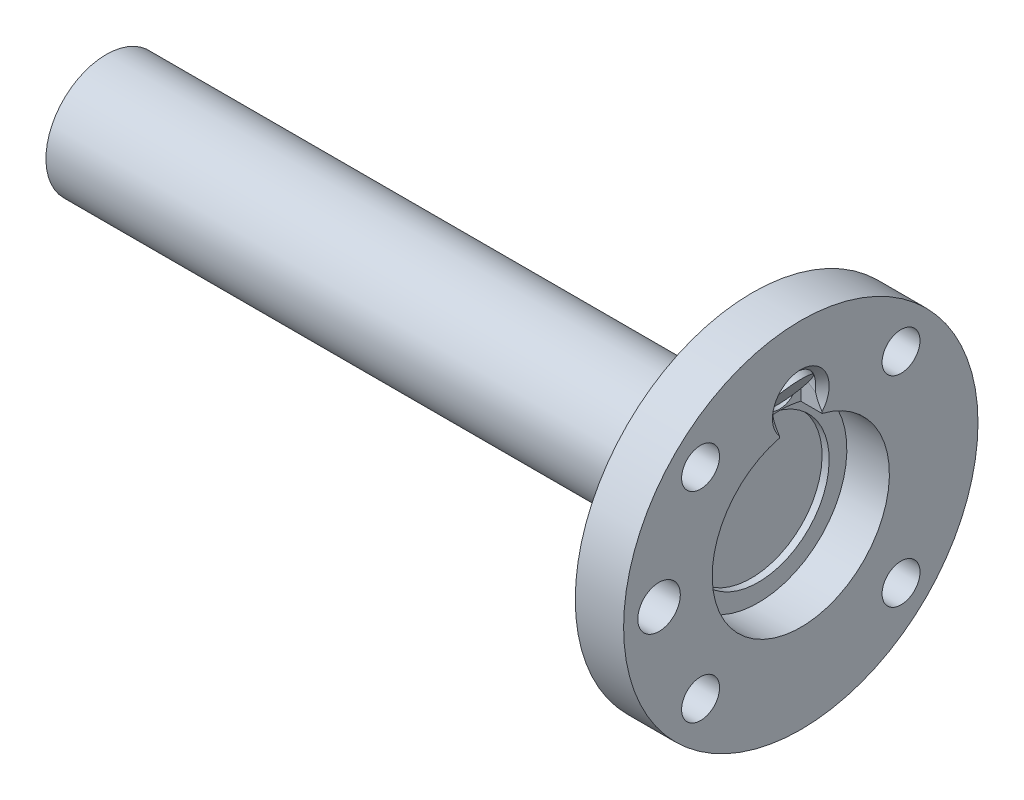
ISO-10303-21;
HEADER;
FILE_DESCRIPTION(('STEP AP214'),'2;1');
FILE_NAME('part.step','',(''),(''),'','','');
FILE_SCHEMA(('AUTOMOTIVE_DESIGN { 1 0 10303 214 1 1 1 1 }'));
ENDSEC;
DATA;
#1=APPLICATION_CONTEXT('core data for automotive mechanical design processes');
#2=APPLICATION_PROTOCOL_DEFINITION('international standard','automotive_design',2000,#1);
#3=PRODUCT_CONTEXT('',#1,'mechanical');
#4=PRODUCT('Part','Part','',(#3));
#5=PRODUCT_RELATED_PRODUCT_CATEGORY('part','',(#4));
#6=PRODUCT_DEFINITION_FORMATION('','',#4);
#7=PRODUCT_DEFINITION_CONTEXT('part definition',#1,'design');
#8=PRODUCT_DEFINITION('design','',#6,#7);
#9=PRODUCT_DEFINITION_SHAPE('','',#8);
#10=(LENGTH_UNIT() NAMED_UNIT(*) SI_UNIT(.MILLI.,.METRE.));
#11=(NAMED_UNIT(*) PLANE_ANGLE_UNIT() SI_UNIT($,.RADIAN.));
#12=(NAMED_UNIT(*) SI_UNIT($,.STERADIAN.) SOLID_ANGLE_UNIT());
#13=UNCERTAINTY_MEASURE_WITH_UNIT(LENGTH_MEASURE(1.E-05),#10,'distance_accuracy_value','');
#14=(GEOMETRIC_REPRESENTATION_CONTEXT(3) GLOBAL_UNCERTAINTY_ASSIGNED_CONTEXT((#13)) GLOBAL_UNIT_ASSIGNED_CONTEXT((#10,
#11,#12)) REPRESENTATION_CONTEXT('',''));
#15=CARTESIAN_POINT('',(0.,0.,0.));
#16=DIRECTION('',(0.,0.,1.));
#17=DIRECTION('',(1.,0.,0.));
#18=AXIS2_PLACEMENT_3D('',#15,#16,#17);
#19=CARTESIAN_POINT('',(812.94729699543,15.4233467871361,961.499994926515));
#20=DIRECTION('',(-0.819152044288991,0.573576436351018,-1.85100474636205E-07));
#21=DIRECTION('',(-0.573576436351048,-0.819152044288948,2.64350873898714E-07));
#22=AXIS2_PLACEMENT_3D('',#19,#20,#21);
#23=PLANE('',#22);
#24=CARTESIAN_POINT('',(812.94729699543,15.4233467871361,961.499994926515));
#25=DIRECTION('',(-0.819152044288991,0.573576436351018,-1.85100474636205E-07));
#26=DIRECTION('',(-0.573576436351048,-0.819152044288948,2.64350873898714E-07));
#27=AXIS2_PLACEMENT_3D('',#24,#25,#26);
#28=CIRCLE('',#27,3.05);
#29=CARTESIAN_POINT('',(812.001379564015,14.072435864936,958.934302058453));
#30=VERTEX_POINT('',#29);
#31=CARTESIAN_POINT('',(812.001379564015,14.0724375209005,964.065688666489));
#32=VERTEX_POINT('',#31);
#33=EDGE_CURVE('E35',#30,#32,#28,.T.);
#34=ORIENTED_EDGE('',*,*,#33,.F.);
#35=DIRECTION('',(0.,-3.22712829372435E-07,-0.999999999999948));
#36=VECTOR('',#35,1.);
#37=CARTESIAN_POINT('',(812.001379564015,14.0724366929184,961.499995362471));
#38=LINE('',#37,#36);
#39=CARTESIAN_POINT('',(812.001379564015,14.0724358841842,958.993946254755));
#40=VERTEX_POINT('',#39);
#41=EDGE_CURVE('E27',#40,#30,#38,.T.);
#42=ORIENTED_EDGE('',*,*,#41,.F.);
#43=CARTESIAN_POINT('',(812.94729699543,15.4233467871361,961.499994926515));
#44=DIRECTION('',(-0.819152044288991,0.573576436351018,-1.85100474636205E-07));
#45=DIRECTION('',(-0.573576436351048,-0.819152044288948,2.64350873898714E-07));
#46=AXIS2_PLACEMENT_3D('',#43,#44,#45);
#47=CIRCLE('',#46,3.00000000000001);
#48=CARTESIAN_POINT('',(812.001379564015,14.0724375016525,964.006044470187));
#49=VERTEX_POINT('',#48);
#50=EDGE_CURVE('E174',#49,#40,#47,.F.);
#51=ORIENTED_EDGE('',*,*,#50,.F.);
#52=EDGE_CURVE('E10',#32,#49,#38,.T.);
#53=ORIENTED_EDGE('',*,*,#52,.F.);
#54=EDGE_LOOP('',(#34,#42,#51,#53));
#55=FACE_BOUND('',#54,.T.);
#56=ADVANCED_FACE('F16',(#55),#23,.F.);
#57=CARTESIAN_POINT('',(821.13881743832,9.687582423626,961.49999677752));
#58=DIRECTION('',(-0.819152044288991,0.573576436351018,-1.85100474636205E-07));
#59=DIRECTION('',(-0.573576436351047,-0.819152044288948,2.64350873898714E-07));
#60=AXIS2_PLACEMENT_3D('',#57,#58,#59);
#61=CYLINDRICAL_SURFACE('',#60,3.05);
#62=ORIENTED_EDGE('',*,*,#33,.T.);
#63=CARTESIAN_POINT('',(812.001379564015,16.085685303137,961.49999471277));
#64=DIRECTION('',(-1.,0.,0.));
#65=DIRECTION('',(0.,0.999999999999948,-3.22712829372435E-07));
#66=AXIS2_PLACEMENT_3D('',#63,#64,#65);
#67=ELLIPSE('',#66,3.72336249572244,3.05);
#68=EDGE_CURVE('E906',#30,#32,#67,.T.);
#69=ORIENTED_EDGE('',*,*,#68,.F.);
#70=EDGE_LOOP('',(#62,#69));
#71=FACE_BOUND('',#70,.T.);
#72=ADVANCED_FACE('F249',(#71),#61,.F.);
#73=CARTESIAN_POINT('',(812.001379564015,14.6848521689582,961.499995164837));
#74=DIRECTION('',(1.,0.,0.));
#75=DIRECTION('',(0.,0.999999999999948,-3.22712829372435E-07));
#76=AXIS2_PLACEMENT_3D('',#73,#74,#75);
#77=CYLINDRICAL_SURFACE('',#76,3.00000363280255);
#78=DIRECTION('',(1.,0.,0.));
#79=VECTOR('',#78,1.);
#80=CARTESIAN_POINT('',(812.001379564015,14.6848512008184,958.499991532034));
#81=LINE('',#80,#79);
#82=CARTESIAN_POINT('',(812.001379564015,14.6848512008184,958.499991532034));
#83=VERTEX_POINT('',#82);
#84=CARTESIAN_POINT('',(813.043115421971,14.6848512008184,958.499991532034));
#85=VERTEX_POINT('',#84);
#86=EDGE_CURVE('E503',#83,#85,#81,.T.);
#87=ORIENTED_EDGE('',*,*,#86,.T.);
#88=CARTESIAN_POINT('',(813.043115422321,14.6848512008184,958.499991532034));
#89=CARTESIAN_POINT('',(813.008522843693,14.7090165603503,958.500001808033));
#90=CARTESIAN_POINT('',(812.973106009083,14.7319251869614,958.500283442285));
#91=CARTESIAN_POINT('',(812.901123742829,14.7757061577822,958.501285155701));
#92=CARTESIAN_POINT('',(812.864560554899,14.7965821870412,958.502004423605));
#93=CARTESIAN_POINT('',(812.790664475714,14.8368551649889,958.503777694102));
#94=CARTESIAN_POINT('',(812.753331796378,14.8562525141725,958.504831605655));
#95=CARTESIAN_POINT('',(812.678028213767,14.893931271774,958.507227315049));
#96=CARTESIAN_POINT('',(812.64005626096,14.9122105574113,958.508569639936));
#97=CARTESIAN_POINT('',(812.601904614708,14.9300743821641,958.510030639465));
#98=B_SPLINE_CURVE_WITH_KNOTS('',3,(#88,#89,#90,#91,#92,#93,#94,#95,#96,#97),.UNSPECIFIED.,.F.,
.F.,(4,2,2,2,4),(0.,0.126501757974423,0.252769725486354,0.379003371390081,0.505469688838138),.UNSPECIFIED.);
#99=CARTESIAN_POINT('',(812.601904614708,14.9300743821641,958.510030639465));
#100=VERTEX_POINT('',#99);
#101=EDGE_CURVE('E268',#85,#100,#98,.T.);
#102=ORIENTED_EDGE('',*,*,#101,.T.);
#103=CARTESIAN_POINT('',(812.430197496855,14.6848521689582,961.499995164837));
#104=DIRECTION('',(-0.819152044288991,0.573576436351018,-1.85100474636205E-07));
#105=DIRECTION('',(0.573576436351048,0.819152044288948,-2.64350873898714E-07));
#106=AXIS2_PLACEMENT_3D('',#103,#104,#105);
#107=ELLIPSE('',#106,3.66232820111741,3.00000363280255);
#108=CARTESIAN_POINT('',(812.714450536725,15.0908066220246,958.527585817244));
#109=VERTEX_POINT('',#108);
#110=EDGE_CURVE('E474',#100,#109,#107,.F.);
#111=ORIENTED_EDGE('',*,*,#110,.T.);
#112=CARTESIAN_POINT('',(814.001976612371,14.6848521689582,961.499995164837));
#113=DIRECTION('',(-0.300705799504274,-0.953716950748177,3.07776695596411E-07));
#114=DIRECTION('',(0.953716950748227,-0.300705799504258,9.70416193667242E-08));
#115=AXIS2_PLACEMENT_3D('',#112,#113,#114);
#116=ELLIPSE('',#115,9.97653461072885,3.00000181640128);
#117=CARTESIAN_POINT('',(812.001379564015,15.3156465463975,958.56705802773));
#118=VERTEX_POINT('',#117);
#119=EDGE_CURVE('E479',#118,#109,#116,.T.);
#120=ORIENTED_EDGE('',*,*,#119,.F.);
#121=CARTESIAN_POINT('',(812.001379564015,14.6848521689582,961.499995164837));
#122=DIRECTION('',(1.,0.,0.));
#123=DIRECTION('',(0.,-0.999999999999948,3.22712829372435E-07));
#124=AXIS2_PLACEMENT_3D('',#121,#122,#123);
#125=CIRCLE('',#124,3.00000363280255);
#126=EDGE_CURVE('E20',#83,#118,#125,.T.);
#127=ORIENTED_EDGE('',*,*,#126,.F.);
#128=EDGE_LOOP('',(#87,#102,#111,#120,#127));
#129=FACE_BOUND('',#128,.T.);
#130=ADVANCED_FACE('F253',(#129),#77,.F.);
#131=CARTESIAN_POINT('',(814.286030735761,17.3352560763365,959.536606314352));
#132=VERTEX_POINT('',#131);
#133=EDGE_CURVE('E277',#132,#100,#28,.T.);
#134=ORIENTED_EDGE('',*,*,#133,.T.);
#135=ORIENTED_EDGE('',*,*,#101,.F.);
#136=CARTESIAN_POINT('',(-1745703.44934668,1222937.43402227,958.499991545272));
#137=CARTESIAN_POINT('',(-1745701.78373717,1222936.26775069,958.499991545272));
#138=CARTESIAN_POINT('',(-1745700.11812766,1222935.10147911,958.499991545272));
#139=CARTESIAN_POINT('',(-1745691.7900801,1222929.27012121,958.499991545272));
#140=CARTESIAN_POINT('',(-1745685.12764206,1222924.60503488,958.499991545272));
#141=CARTESIAN_POINT('',(-1745651.81545183,1222901.27960327,958.499991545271));
#142=CARTESIAN_POINT('',(-1745625.16569965,1222882.61925798,958.499991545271));
#143=CARTESIAN_POINT('',(-1745491.91693873,1222789.31753152,958.499991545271));
#144=CARTESIAN_POINT('',(-1745385.31793,1222714.67615036,958.499991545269));
#145=CARTESIAN_POINT('',(-1744852.32288634,1222341.46924455,958.499991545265));
#146=CARTESIAN_POINT('',(-1744425.92685139,1222042.90371993,958.499991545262));
#147=CARTESIAN_POINT('',(-1742293.94667655,1220550.07609697,958.499991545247));
#148=CARTESIAN_POINT('',(-1740588.36253638,1219355.81399903,958.499991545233));
#149=CARTESIAN_POINT('',(-1732060.44183403,1213384.50351147,958.499991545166));
#150=CARTESIAN_POINT('',(-1725238.10526736,1208607.45512826,958.499991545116));
#151=CARTESIAN_POINT('',(-1691126.42240969,1184722.21324695,958.499991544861));
#152=CARTESIAN_POINT('',(-1663837.07604573,1165614.01985304,958.499991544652));
#153=CARTESIAN_POINT('',(-1581969.03670651,1108289.44002456,958.499991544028));
#154=CARTESIAN_POINT('',(-1527390.34348387,1070073.05394328,958.499991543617));
#155=CARTESIAN_POINT('',(-1445522.30308794,1012748.47562394,958.499991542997));
#156=CARTESIAN_POINT('',(-1418232.95619563,993640.282984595,958.49999154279));
#157=CARTESIAN_POINT('',(-1363654.26220882,955423.897994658,958.499991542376));
#158=CARTESIAN_POINT('',(-1336364.91511433,936315.705644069,958.499991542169));
#159=CARTESIAN_POINT('',(-1199918.17910917,840774.744651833,958.499991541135));
#160=CARTESIAN_POINT('',(-1090760.78860055,764341.97829232,958.499991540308));
#161=CARTESIAN_POINT('',(-927024.699226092,649692.833910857,958.499991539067));
#162=CARTESIAN_POINT('',(-872446.002166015,611476.453310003,958.499991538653));
#163=CARTESIAN_POINT('',(-763288.606548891,535043.694246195,958.499991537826));
#164=CARTESIAN_POINT('',(-708709.907991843,496827.315783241,958.499991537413));
#165=CARTESIAN_POINT('',(-599552.508973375,420394.561577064,958.499991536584));
#166=CARTESIAN_POINT('',(-544973.808511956,382178.185833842,958.499991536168));
#167=CARTESIAN_POINT('',(-435816.405015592,305745.438022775,958.499991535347));
#168=CARTESIAN_POINT('',(-381237.701980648,267529.065954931,958.499991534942));
#169=CARTESIAN_POINT('',(-272080.292227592,191096.32707936,958.49999153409));
#170=CARTESIAN_POINT('',(-217501.585509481,152879.960271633,958.499991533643));
#171=CARTESIAN_POINT('',(-135633.520746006,95555.4167527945,958.499991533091));
#172=CARTESIAN_POINT('',(-108344.165043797,76447.2366953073,958.499991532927));
#173=CARTESIAN_POINT('',(-53765.451397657,38230.8797818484,958.499991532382));
#174=CARTESIAN_POINT('',(-26476.0934537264,19122.7029258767,958.499991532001));
#175=CARTESIAN_POINT('',(814.931873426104,13.3623314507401,958.499991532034));
#176=CARTESIAN_POINT('',(816.597483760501,12.1960610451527,958.499991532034));
#177=CARTESIAN_POINT('',(824.925535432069,6.36470901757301,958.499991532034));
#178=CARTESIAN_POINT('',(831.587976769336,1.69962739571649,958.499991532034));
#179=CARTESIAN_POINT('',(864.900183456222,-21.6257807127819,958.499991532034));
#180=CARTESIAN_POINT('',(891.549948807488,-40.2861071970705,958.499991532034));
#181=CARTESIAN_POINT('',(1024.79877557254,-133.58773960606,958.499991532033));
#182=CARTESIAN_POINT('',(1131.39783701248,-208.229045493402,958.499991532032));
#183=CARTESIAN_POINT('',(1664.3931443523,-581.43557473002,958.499991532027));
#184=CARTESIAN_POINT('',(2090.78939067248,-880.000797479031,958.499991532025));
#185=CARTESIAN_POINT('',(4222.77062452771,-2372.8269080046,958.49999153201));
#186=CARTESIAN_POINT('',(5928.35561882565,-3567.08778612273,958.499991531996));
#187=CARTESIAN_POINT('',(14456.2806279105,-9538.39212302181,958.499991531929));
#188=CARTESIAN_POINT('',(21278.6207554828,-14315.4354207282,958.499991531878));
#189=CARTESIAN_POINT('',(41745.6415481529,-28646.5647283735,958.499991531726));
#190=CARTESIAN_POINT('',(55390.3226232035,-38200.650152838,958.499991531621));
#191=CARTESIAN_POINT('',(82679.6863412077,-57308.8187625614,958.499991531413));
#192=CARTESIAN_POINT('',(96324.3689841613,-66862.9019478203,958.49999153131));
#193=CARTESIAN_POINT('',(123613.736629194,-85971.0649491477,958.499991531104));
#194=CARTESIAN_POINT('',(137258.421631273,-95525.1447652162,958.499991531));
#195=CARTESIAN_POINT('',(157725.452731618,-109856.259351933,958.499991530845));
#196=CARTESIAN_POINT('',(164547.797031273,-114633.296691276,958.499991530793));
#197=CARTESIAN_POINT('',(178192.487512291,-124187.368682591,958.49999153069));
#198=CARTESIAN_POINT('',(185014.833693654,-128964.403334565,958.499991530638));
#199=CARTESIAN_POINT('',(195248.356231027,-136129.950649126,958.499991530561));
#200=CARTESIAN_POINT('',(198659.530954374,-138518.465643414,958.499991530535));
#201=CARTESIAN_POINT('',(205481.882119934,-143295.493177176,958.499991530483));
#202=CARTESIAN_POINT('',(208893.058562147,-145684.00571665,958.499991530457));
#203=CARTESIAN_POINT('',(214009.827505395,-149266.768413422,958.499991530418));
#204=CARTESIAN_POINT('',(215715.417866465,-150461.021626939,958.499991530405));
#205=CARTESIAN_POINT('',(218273.805782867,-152252.398055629,958.499991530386));
#206=CARTESIAN_POINT('',(219126.6021508,-152849.522966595,958.49999153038));
#207=CARTESIAN_POINT('',(220405.799820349,-153745.205880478,958.49999153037));
#208=CARTESIAN_POINT('',(220832.19956314,-154043.766109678,958.499991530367));
#209=CARTESIAN_POINT('',(221258.600035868,-154342.325296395,958.499991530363));
#210=B_SPLINE_CURVE_WITH_KNOTS('',3,(#136,#137,#138,#139,#140,#141,#142,#143,#144,#145,#146,
#147,#148,#149,#150,#151,#152,#153,#154,#155,#156,#157,#158,#159,#160,#161,#162,#163,#164,#165,
#166,#167,#168,#169,#170,#171,#172,#173,#174,#175,#176,#177,#178,#179,#180,#181,#182,#183,#184,
#185,#186,#187,#188,#189,#190,#191,#192,#193,#194,#195,#196,#197,#198,#199,#200,#201,#202,#203,
#204,#205,#206,#207,#208,#209),.UNSPECIFIED.,.F.,.F.,(4,2,2,2,2,2,2,2,2,2,2,2,2,2,2,2,2,2,2,2,2,
2,2,2,2,2,2,2,2,2,2,2,2,2,2,2,4),(0.,6.10000000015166,30.500000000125,128.100000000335,
518.500000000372,2080.10000000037,8326.50000000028,33312.1000000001,133254.5,333139.3,433081.7,
533024.1,932793.700000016,1132678.50000003,1332563.30000004,1532448.10000004,1732332.90000004,
1932217.70000004,2032160.10000003,2132102.50000003,2132108.60000003,2132133.00000003,
2132230.60000003,2132621.00000003,2134182.60000003,2140429.00000003,2165414.60000003,
2215385.80000003,2265357.00000003,2315328.20000003,2340313.80000004,2365299.40000005,
2377792.20000006,2390285.00000006,2396531.40000006,2399654.60000006,2401216.20000007),.UNSPECIFIED.);
#211=CARTESIAN_POINT('',(814.094527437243,13.9486461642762,958.499991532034));
#212=VERTEX_POINT('',#211);
#213=EDGE_CURVE('E261',#212,#85,#210,.F.);
#214=ORIENTED_EDGE('',*,*,#213,.F.);
#215=CARTESIAN_POINT('',(815.468407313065,10.5755408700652,963.210747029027));
#216=CARTESIAN_POINT('',(815.429884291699,10.6320476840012,963.246443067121));
#217=CARTESIAN_POINT('',(815.391517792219,10.6891391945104,963.28137036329));
#218=CARTESIAN_POINT('',(815.315284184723,10.8044600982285,963.349862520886));
#219=CARTESIAN_POINT('',(815.277417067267,10.8626894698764,963.383427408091));
#220=CARTESIAN_POINT('',(815.164799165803,11.0391076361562,963.48238073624));
#221=CARTESIAN_POINT('',(815.091076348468,11.1589617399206,963.545987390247));
#222=CARTESIAN_POINT('',(814.946536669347,11.4053978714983,963.670423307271));
#223=CARTESIAN_POINT('',(814.875798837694,11.5320633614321,963.731179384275));
#224=CARTESIAN_POINT('',(814.740348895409,11.7902977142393,963.848915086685));
#225=CARTESIAN_POINT('',(814.675636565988,11.9218663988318,963.905894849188));
#226=CARTESIAN_POINT('',(814.547960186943,12.2034270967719,964.021155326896));
#227=CARTESIAN_POINT('',(814.485792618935,12.3539591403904,964.079013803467));
#228=CARTESIAN_POINT('',(814.372917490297,12.661568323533,964.188364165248));
#229=CARTESIAN_POINT('',(814.322209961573,12.8186454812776,964.239856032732));
#230=CARTESIAN_POINT('',(814.234143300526,13.137776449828,964.333625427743));
#231=CARTESIAN_POINT('',(814.196681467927,13.2997808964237,964.375972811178));
#232=CARTESIAN_POINT('',(814.135009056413,13.6288941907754,964.448804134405));
#233=CARTESIAN_POINT('',(814.110791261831,13.7960002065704,964.479294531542));
#234=CARTESIAN_POINT('',(814.080815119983,14.0770267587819,964.517455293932));
#235=CARTESIAN_POINT('',(814.071591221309,14.1900246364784,964.529348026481));
#236=CARTESIAN_POINT('',(814.05814949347,14.4168531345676,964.545549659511));
#237=CARTESIAN_POINT('',(814.053930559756,14.5306835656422,964.549860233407));
#238=CARTESIAN_POINT('',(814.049900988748,14.7586084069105,964.550124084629));
#239=CARTESIAN_POINT('',(814.050096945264,14.8727029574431,964.546064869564));
#240=CARTESIAN_POINT('',(814.054242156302,15.1001585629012,964.528929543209));
#241=CARTESIAN_POINT('',(814.058191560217,15.2135195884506,964.515853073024));
#242=CARTESIAN_POINT('',(814.069181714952,15.4391685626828,964.480108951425));
#243=CARTESIAN_POINT('',(814.076238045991,15.5514481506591,964.45739298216));
#244=CARTESIAN_POINT('',(814.092754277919,15.7733504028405,964.402031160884));
#245=CARTESIAN_POINT('',(814.102213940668,15.8829733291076,964.369386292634));
#246=CARTESIAN_POINT('',(814.122876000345,16.0985247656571,964.293986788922));
#247=CARTESIAN_POINT('',(814.134078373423,16.2044533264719,964.251232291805));
#248=CARTESIAN_POINT('',(814.157600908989,16.4115033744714,964.155591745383));
#249=CARTESIAN_POINT('',(814.1699209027,16.512625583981,964.102707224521));
#250=CARTESIAN_POINT('',(814.19376388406,16.698538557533,963.993067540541));
#251=CARTESIAN_POINT('',(814.20523357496,16.7839260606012,963.937311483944));
#252=CARTESIAN_POINT('',(814.228207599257,16.9490787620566,963.818032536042));
#253=CARTESIAN_POINT('',(814.23971192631,17.0288449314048,963.754510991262));
#254=CARTESIAN_POINT('',(814.262371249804,17.1817734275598,963.62013738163));
#255=CARTESIAN_POINT('',(814.273526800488,17.2549466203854,963.549297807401));
#256=CARTESIAN_POINT('',(814.295164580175,17.3939435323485,963.400704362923));
#257=CARTESIAN_POINT('',(814.30564704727,17.4597698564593,963.322952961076));
#258=CARTESIAN_POINT('',(814.328996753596,17.604061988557,963.133820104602));
#259=CARTESIAN_POINT('',(814.341480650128,17.6793350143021,963.019921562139));
#260=CARTESIAN_POINT('',(814.364035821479,17.8133997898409,962.782614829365));
#261=CARTESIAN_POINT('',(814.374107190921,17.8721921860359,962.659207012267));
#262=CARTESIAN_POINT('',(814.393312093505,17.9833149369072,962.375401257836));
#263=CARTESIAN_POINT('',(814.401681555,18.030955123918,962.213079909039));
#264=CARTESIAN_POINT('',(814.413250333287,18.0965703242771,961.882311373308));
#265=CARTESIAN_POINT('',(814.41644806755,18.1145362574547,961.713862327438));
#266=CARTESIAN_POINT('',(814.41738061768,18.1197850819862,961.387859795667));
#267=CARTESIAN_POINT('',(814.41546881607,18.1090527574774,961.230336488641));
#268=CARTESIAN_POINT('',(814.40706322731,18.0615160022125,960.919448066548));
#269=CARTESIAN_POINT('',(814.400570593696,18.024718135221,960.766081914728));
#270=CARTESIAN_POINT('',(814.383514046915,17.9267900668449,960.468543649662));
#271=CARTESIAN_POINT('',(814.372972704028,17.86579469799,960.324325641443));
#272=CARTESIAN_POINT('',(814.348547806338,17.7217053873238,960.047722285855));
#273=CARTESIAN_POINT('',(814.334663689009,17.6386077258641,959.915338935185));
#274=CARTESIAN_POINT('',(814.303837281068,17.4489661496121,959.659727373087));
#275=CARTESIAN_POINT('',(814.286787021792,17.3415489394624,959.537161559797));
#276=CARTESIAN_POINT('',(814.251365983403,17.1090758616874,959.310365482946));
#277=CARTESIAN_POINT('',(814.232994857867,16.9840153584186,959.20614005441));
#278=CARTESIAN_POINT('',(814.194925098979,16.7091901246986,959.009963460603));
#279=CARTESIAN_POINT('',(814.17523773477,16.5582497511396,958.919659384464));
#280=CARTESIAN_POINT('',(814.138070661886,16.2441770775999,958.763026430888));
#281=CARTESIAN_POINT('',(814.120591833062,16.0810399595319,958.696707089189));
#282=CARTESIAN_POINT('',(814.088580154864,15.7298012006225,958.582532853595));
#283=CARTESIAN_POINT('',(814.074519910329,15.5408383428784,958.537203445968));
#284=CARTESIAN_POINT('',(814.055140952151,15.1578931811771,958.47424822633));
#285=CARTESIAN_POINT('',(814.049825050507,14.9639092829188,958.456631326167));
#286=CARTESIAN_POINT('',(814.050994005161,14.6617087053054,958.448724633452));
#287=CARTESIAN_POINT('',(814.053291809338,14.5535973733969,958.449782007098));
#288=CARTESIAN_POINT('',(814.062180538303,14.3378360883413,958.459023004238));
#289=CARTESIAN_POINT('',(814.06877167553,14.2301861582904,958.467206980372));
#290=CARTESIAN_POINT('',(814.086702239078,14.0160389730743,958.489981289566));
#291=CARTESIAN_POINT('',(814.098038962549,13.9095410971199,958.504567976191));
#292=CARTESIAN_POINT('',(814.125782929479,13.6981262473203,958.53934889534));
#293=CARTESIAN_POINT('',(814.142191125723,13.5932095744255,958.559544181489));
#294=CARTESIAN_POINT('',(814.1889320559,13.3379835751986,958.615012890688));
#295=CARTESIAN_POINT('',(814.222202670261,13.1887840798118,958.652963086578));
#296=CARTESIAN_POINT('',(814.299636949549,12.8954450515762,958.736543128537));
#297=CARTESIAN_POINT('',(814.343805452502,12.7513077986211,958.782176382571));
#298=CARTESIAN_POINT('',(814.44223939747,12.467716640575,958.879373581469));
#299=CARTESIAN_POINT('',(814.496555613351,12.3282906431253,958.93096682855));
#300=CARTESIAN_POINT('',(814.613575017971,12.0548234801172,959.038572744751));
#301=CARTESIAN_POINT('',(814.676277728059,11.9207820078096,959.094585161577));
#302=CARTESIAN_POINT('',(814.796776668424,11.6808045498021,959.200321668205));
#303=CARTESIAN_POINT('',(814.853510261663,11.5740562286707,959.249430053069));
#304=CARTESIAN_POINT('',(814.970548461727,11.3638428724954,959.350302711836));
#305=CARTESIAN_POINT('',(815.030852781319,11.2603775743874,959.402066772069));
#306=CARTESIAN_POINT('',(815.153366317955,11.0578606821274,959.50790286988));
#307=CARTESIAN_POINT('',(815.215542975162,10.9587704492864,959.561938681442));
#308=CARTESIAN_POINT('',(815.310104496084,10.8124731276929,959.645581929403));
#309=CARTESIAN_POINT('',(815.341839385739,10.7640995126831,959.673893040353));
#310=CARTESIAN_POINT('',(815.405633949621,10.6681499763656,959.731487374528));
#311=CARTESIAN_POINT('',(815.437693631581,10.6205740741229,959.760770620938));
#312=CARTESIAN_POINT('',(815.469860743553,10.5734082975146,959.790593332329));
#313=B_SPLINE_CURVE_WITH_KNOTS('',3,(#215,#216,#217,#218,#219,#220,#221,#222,#223,#224,#225,
#226,#227,#228,#229,#230,#231,#232,#233,#234,#235,#236,#237,#238,#239,#240,#241,#242,#243,#244,
#245,#246,#247,#248,#249,#250,#251,#252,#253,#254,#255,#256,#257,#258,#259,#260,#261,#262,#263,
#264,#265,#266,#267,#268,#269,#270,#271,#272,#273,#274,#275,#276,#277,#278,#279,#280,#281,#282,
#283,#284,#285,#286,#287,#288,#289,#290,#291,#292,#293,#294,#295,#296,#297,#298,#299,#300,#301,
#302,#303,#304,#305,#306,#307,#308,#309,#310,#311,#312),.UNSPECIFIED.,.F.,.F.,(4,2,2,2,2,2,2,2,
2,2,2,2,2,2,2,2,2,2,2,2,2,2,2,2,2,2,2,2,2,2,2,2,2,2,2,2,2,2,2,2,2,2,2,2,2,2,2,2,4),(0.,
0.231417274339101,0.462830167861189,0.925920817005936,1.39758179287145,1.86922563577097,
2.387209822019,2.90519545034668,3.41907195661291,3.93266821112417,4.27432932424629,
4.61591502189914,4.95801092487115,5.30012044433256,5.64396542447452,5.98777634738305,
6.3315825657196,6.67533695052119,6.98277642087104,7.29016265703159,7.59703264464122,
7.90379347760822,8.31370474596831,8.72359993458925,9.22891267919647,9.73438001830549,
10.205808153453,10.6771176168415,11.1458369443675,11.6146352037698,12.1041343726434,
12.5937623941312,13.1225286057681,13.6515048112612,14.2336425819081,14.8159675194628,
15.140112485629,15.4642734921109,15.7882501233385,16.1122876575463,16.5840407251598,
17.0560036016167,17.530394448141,18.0047582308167,18.3960805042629,18.7873713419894,
19.1738485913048,19.3670668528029,19.5602897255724),.UNSPECIFIED.);
#314=EDGE_CURVE('E238',#132,#212,#313,.T.);
#315=ORIENTED_EDGE('',*,*,#314,.F.);
#316=EDGE_LOOP('',(#134,#135,#214,#315));
#317=FACE_BOUND('',#316,.T.);
#318=ADVANCED_FACE('F256',(#317),#61,.F.);
#319=CARTESIAN_POINT('',(814.243432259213,17.2744191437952,959.526783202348));
#320=VERTEX_POINT('',#319);
#321=EDGE_CURVE('E173',#109,#320,#47,.F.);
#322=ORIENTED_EDGE('',*,*,#321,.F.);
#323=ORIENTED_EDGE('',*,*,#110,.F.);
#324=ORIENTED_EDGE('',*,*,#133,.F.);
#325=CARTESIAN_POINT('',(813.828137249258,16.6813170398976,961.499994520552));
#326=DIRECTION('',(-0.819152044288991,0.573576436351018,-1.85100474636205E-07));
#327=DIRECTION('',(0.573576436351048,0.819152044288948,-2.64350873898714E-07));
#328=AXIS2_PLACEMENT_3D('',#325,#326,#327);
#329=ELLIPSE('',#328,3.45083395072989,2.01813356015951);
#330=EDGE_CURVE('E164',#320,#132,#329,.F.);
#331=ORIENTED_EDGE('',*,*,#330,.F.);
#332=EDGE_LOOP('',(#322,#323,#324,#331));
#333=FACE_BOUND('',#332,.T.);
#334=ADVANCED_FACE('F462',(#333),#23,.F.);
#335=CARTESIAN_POINT('',(812.601904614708,14.9300763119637,964.489959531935));
#336=VERTEX_POINT('',#335);
#337=CARTESIAN_POINT('',(814.286030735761,17.3352573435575,963.463382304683));
#338=VERTEX_POINT('',#337);
#339=EDGE_CURVE('E275',#336,#338,#28,.T.);
#340=ORIENTED_EDGE('',*,*,#339,.F.);
#341=CARTESIAN_POINT('',(812.430197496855,14.6848521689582,961.499995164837));
#342=DIRECTION('',(-0.819152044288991,0.573576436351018,-1.85100474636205E-07));
#343=DIRECTION('',(0.573576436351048,0.819152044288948,-2.64350873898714E-07));
#344=AXIS2_PLACEMENT_3D('',#341,#342,#343);
#345=ELLIPSE('',#344,3.66232820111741,3.00000363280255);
#346=CARTESIAN_POINT('',(812.714450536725,15.0908085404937,964.472404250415));
#347=VERTEX_POINT('',#346);
#348=EDGE_CURVE('E168',#347,#336,#345,.F.);
#349=ORIENTED_EDGE('',*,*,#348,.F.);
#350=CARTESIAN_POINT('',(814.243432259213,17.2744204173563,963.473205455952));
#351=VERTEX_POINT('',#350);
#352=EDGE_CURVE('E162',#351,#347,#47,.F.);
#353=ORIENTED_EDGE('',*,*,#352,.F.);
#354=EDGE_CURVE('E151',#338,#351,#329,.F.);
#355=ORIENTED_EDGE('',*,*,#354,.F.);
#356=EDGE_LOOP('',(#340,#349,#353,#355));
#357=FACE_BOUND('',#356,.T.);
#358=ADVANCED_FACE('F166',(#357),#23,.F.);
#359=CARTESIAN_POINT('',(-1745703.44934668,1222937.43402395,963.710693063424));
#360=CARTESIAN_POINT('',(-1745701.78373717,1222936.26775237,963.710693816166));
#361=CARTESIAN_POINT('',(-1745700.11812766,1222935.10148079,963.710694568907));
#362=CARTESIAN_POINT('',(-1745691.7900801,1222929.27012289,963.710698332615));
#363=CARTESIAN_POINT('',(-1745685.12764206,1222924.60503656,963.710701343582));
#364=CARTESIAN_POINT('',(-1745651.81545183,1222901.27960495,963.710716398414));
#365=CARTESIAN_POINT('',(-1745625.16569965,1222882.61925966,963.71072844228));
#366=CARTESIAN_POINT('',(-1745491.91693873,1222789.3175332,963.710788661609));
#367=CARTESIAN_POINT('',(-1745385.31793,1222714.67615204,963.710836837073));
#368=CARTESIAN_POINT('',(-1744852.32288634,1222341.46924623,963.71107771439));
#369=CARTESIAN_POINT('',(-1744425.92685139,1222042.90372162,963.711270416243));
#370=CARTESIAN_POINT('',(-1742293.94667655,1220550.07609866,963.71223392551));
#371=CARTESIAN_POINT('',(-1740588.36253638,1219355.81400072,963.713004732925));
#372=CARTESIAN_POINT('',(-1732060.44183403,1213384.50351315,963.716858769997));
#373=CARTESIAN_POINT('',(-1725238.10526736,1208607.45512995,963.719941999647));
#374=CARTESIAN_POINT('',(-1691126.42240969,1184722.21324864,963.735358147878));
#375=CARTESIAN_POINT('',(-1663837.07604573,1165614.01985473,963.747691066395));
#376=CARTESIAN_POINT('',(-1581969.03670651,1108289.44002627,963.784689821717));
#377=CARTESIAN_POINT('',(-1527390.34348387,1070073.05394499,963.80935565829));
#378=CARTESIAN_POINT('',(-1445522.30308794,1012748.47562567,963.846354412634));
#379=CARTESIAN_POINT('',(-1418232.95619563,993640.282986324,963.858687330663));
#380=CARTESIAN_POINT('',(-1363654.26220882,955423.897996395,963.883353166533));
#381=CARTESIAN_POINT('',(-1336364.91511433,936315.705645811,963.895686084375));
#382=CARTESIAN_POINT('',(-1199918.17910917,840774.744653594,963.957350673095));
#383=CARTESIAN_POINT('',(-1090760.78860055,764341.978294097,964.0066823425));
#384=CARTESIAN_POINT('',(-927024.699226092,649692.833912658,964.080679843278));
#385=CARTESIAN_POINT('',(-872446.002166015,611476.453311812,964.105345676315));
#386=CARTESIAN_POINT('',(-763288.606548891,535043.69424802,964.154677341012));
#387=CARTESIAN_POINT('',(-708709.907991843,496827.315785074,964.17934317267));
#388=CARTESIAN_POINT('',(-599552.508973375,420394.561578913,964.228674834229));
#389=CARTESIAN_POINT('',(-544973.808511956,382178.185835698,964.253340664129));
#390=CARTESIAN_POINT('',(-435816.405015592,305745.438024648,964.302672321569));
#391=CARTESIAN_POINT('',(-381237.701980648,267529.065956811,964.327338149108));
#392=CARTESIAN_POINT('',(-272080.292227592,191096.327081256,964.37666980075));
#393=CARTESIAN_POINT('',(-217501.585509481,152879.960273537,964.401335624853));
#394=CARTESIAN_POINT('',(-135633.520746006,95555.4167547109,964.438334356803));
#395=CARTESIAN_POINT('',(-108344.165043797,76447.2366972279,964.450667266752));
#396=CARTESIAN_POINT('',(-53765.4513976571,38230.8797837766,964.475333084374));
#397=CARTESIAN_POINT('',(-26476.0934537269,19122.7029278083,964.487665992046));
#398=CARTESIAN_POINT('',(814.931873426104,13.3623333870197,964.499999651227));
#399=CARTESIAN_POINT('',(816.597483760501,12.1960629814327,964.500000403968));
#400=CARTESIAN_POINT('',(824.925535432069,6.3647109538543,964.500004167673));
#401=CARTESIAN_POINT('',(831.587976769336,1.69962933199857,964.500007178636));
#402=CARTESIAN_POINT('',(864.900183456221,-21.6257787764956,964.500022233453));
#403=CARTESIAN_POINT('',(891.549948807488,-40.2861052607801,964.500034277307));
#404=CARTESIAN_POINT('',(1024.79877557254,-133.58773766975,964.500094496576));
#405=CARTESIAN_POINT('',(1131.39783701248,-208.229043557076,964.50014267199));
#406=CARTESIAN_POINT('',(1664.3931443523,-581.435572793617,964.500383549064));
#407=CARTESIAN_POINT('',(2090.78939067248,-880.000795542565,964.500576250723));
#408=CARTESIAN_POINT('',(4222.77062452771,-2372.82690606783,964.501539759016));
#409=CARTESIAN_POINT('',(5928.35561882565,-3567.0877841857,964.502310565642));
#410=CARTESIAN_POINT('',(14456.2806279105,-9538.39212108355,964.50616459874));
#411=CARTESIAN_POINT('',(21278.6207554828,-14315.435418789,964.50924782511));
#412=CARTESIAN_POINT('',(41745.6415481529,-28646.5647264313,964.518497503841));
#413=CARTESIAN_POINT('',(55390.3226232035,-38200.6501508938,964.524663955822));
#414=CARTESIAN_POINT('',(82679.6863412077,-57308.8187606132,964.536996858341));
#415=CARTESIAN_POINT('',(96324.3689841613,-66862.9019458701,964.543163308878));
#416=CARTESIAN_POINT('',(123613.736629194,-85971.0649471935,964.555496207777));
#417=CARTESIAN_POINT('',(137258.421631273,-95525.14476326,964.56166265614));
#418=CARTESIAN_POINT('',(157725.452731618,-109856.259349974,964.570912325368));
#419=CARTESIAN_POINT('',(164547.797031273,-114633.296689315,964.573995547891));
#420=CARTESIAN_POINT('',(178192.487512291,-124187.368680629,964.580161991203));
#421=CARTESIAN_POINT('',(185014.833693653,-128964.403332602,964.583245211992));
#422=CARTESIAN_POINT('',(195248.356231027,-136129.950647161,964.587870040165));
#423=CARTESIAN_POINT('',(198659.530954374,-138518.465641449,964.589411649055));
#424=CARTESIAN_POINT('',(205481.882119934,-143295.49317521,964.592494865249));
#425=CARTESIAN_POINT('',(208893.058562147,-145684.005714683,964.594036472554));
#426=CARTESIAN_POINT('',(214009.827505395,-149266.768411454,964.596348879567));
#427=CARTESIAN_POINT('',(215715.417866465,-150461.021624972,964.597119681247));
#428=CARTESIAN_POINT('',(218273.805782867,-152252.398053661,964.598275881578));
#429=CARTESIAN_POINT('',(219126.6021508,-152849.522964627,964.598661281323));
#430=CARTESIAN_POINT('',(220405.799820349,-153745.20587851,964.599239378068));
#431=CARTESIAN_POINT('',(220832.19956314,-154043.76610771,964.599432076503));
#432=CARTESIAN_POINT('',(221258.600035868,-154342.325294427,964.599624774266));
#433=B_SPLINE_CURVE_WITH_KNOTS('',3,(#359,#360,#361,#362,#363,#364,#365,#366,#367,#368,#369,
#370,#371,#372,#373,#374,#375,#376,#377,#378,#379,#380,#381,#382,#383,#384,#385,#386,#387,#388,
#389,#390,#391,#392,#393,#394,#395,#396,#397,#398,#399,#400,#401,#402,#403,#404,#405,#406,#407,
#408,#409,#410,#411,#412,#413,#414,#415,#416,#417,#418,#419,#420,#421,#422,#423,#424,#425,#426,
#427,#428,#429,#430,#431,#432),.UNSPECIFIED.,.F.,.F.,(4,2,2,2,2,2,2,2,2,2,2,2,2,2,2,2,2,2,2,2,2,
2,2,2,2,2,2,2,2,2,2,2,2,2,2,2,4),(0.,6.10000000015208,30.5000000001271,128.100000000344,
518.500000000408,2080.10000000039,8326.50000000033,33312.1000000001,133254.5,333139.3,433081.7,
533024.1,932793.700000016,1132678.50000003,1332563.30000004,1532448.10000004,1732332.90000004,
1932217.70000004,2032160.10000003,2132102.50000003,2132108.60000003,2132133.00000003,
2132230.60000003,2132621.00000003,2134182.60000003,2140429.00000003,2165414.60000003,
2215385.80000003,2265357.00000003,2315328.20000003,2340313.80000004,2365299.40000005,
2377792.20000006,2390285.00000006,2396531.40000006,2399654.60000006,2401216.20000007),.UNSPECIFIED.);
#434=CARTESIAN_POINT('',(813.043115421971,14.6848531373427,964.499998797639));
#435=VERTEX_POINT('',#434);
#436=CARTESIAN_POINT('',(814.094527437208,13.9486481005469,964.499999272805));
#437=VERTEX_POINT('',#436);
#438=EDGE_CURVE('E231',#435,#437,#433,.T.);
#439=ORIENTED_EDGE('',*,*,#438,.F.);
#440=CARTESIAN_POINT('',(812.601904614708,14.9300763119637,964.489959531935));
#441=CARTESIAN_POINT('',(812.64005626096,14.9122124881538,964.491420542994));
#442=CARTESIAN_POINT('',(812.678028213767,14.8939332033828,964.492762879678));
#443=CARTESIAN_POINT('',(812.753331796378,14.8562544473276,964.495158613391));
#444=CARTESIAN_POINT('',(812.790664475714,14.8368570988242,964.496212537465));
#445=CARTESIAN_POINT('',(812.864560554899,14.7965841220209,964.497985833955));
#446=CARTESIAN_POINT('',(812.901123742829,14.7757080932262,964.498705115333));
#447=CARTESIAN_POINT('',(812.973106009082,14.731927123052,964.499706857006));
#448=CARTESIAN_POINT('',(813.008522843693,14.7090184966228,964.499988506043));
#449=CARTESIAN_POINT('',(813.043115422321,14.6848531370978,964.499998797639));
#450=B_SPLINE_CURVE_WITH_KNOTS('',3,(#440,#441,#442,#443,#444,#445,#446,#447,#448,#449),
.UNSPECIFIED.,.F.,.F.,(4,2,2,2,4),(0.,0.126466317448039,0.252699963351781,0.37896793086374,
0.505469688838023),.UNSPECIFIED.);
#451=EDGE_CURVE('E237',#336,#435,#450,.T.);
#452=ORIENTED_EDGE('',*,*,#451,.F.);
#453=ORIENTED_EDGE('',*,*,#339,.T.);
#454=EDGE_CURVE('E43',#437,#338,#313,.T.);
#455=ORIENTED_EDGE('',*,*,#454,.F.);
#456=EDGE_LOOP('',(#439,#452,#453,#455));
#457=FACE_BOUND('',#456,.T.);
#458=ADVANCED_FACE('F255',(#457),#61,.F.);
#459=ORIENTED_EDGE('',*,*,#348,.T.);
#460=ORIENTED_EDGE('',*,*,#451,.T.);
#461=DIRECTION('',(1.,0.,0.));
#462=VECTOR('',#461,1.);
#463=CARTESIAN_POINT('',(812.001379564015,14.6848531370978,964.499998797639));
#464=LINE('',#463,#462);
#465=CARTESIAN_POINT('',(812.001379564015,14.6848531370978,964.499998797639));
#466=VERTEX_POINT('',#465);
#467=EDGE_CURVE('E508',#466,#435,#464,.T.);
#468=ORIENTED_EDGE('',*,*,#467,.F.);
#469=CARTESIAN_POINT('',(812.001379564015,15.3156484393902,964.432931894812));
#470=VERTEX_POINT('',#469);
#471=EDGE_CURVE('E493',#470,#466,#125,.T.);
#472=ORIENTED_EDGE('',*,*,#471,.F.);
#473=EDGE_CURVE('E485',#347,#470,#116,.T.);
#474=ORIENTED_EDGE('',*,*,#473,.F.);
#475=EDGE_LOOP('',(#459,#460,#468,#472,#474));
#476=FACE_BOUND('',#475,.T.);
#477=ADVANCED_FACE('F227',(#476),#77,.F.);
#478=CARTESIAN_POINT('',(812.001379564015,14.6848521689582,961.499995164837));
#479=DIRECTION('',(-1.,0.,0.));
#480=DIRECTION('',(0.,-0.999999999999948,3.22712829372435E-07));
#481=AXIS2_PLACEMENT_3D('',#478,#479,#480);
#482=PLANE('',#481);
#483=ORIENTED_EDGE('',*,*,#68,.T.);
#484=ORIENTED_EDGE('',*,*,#52,.T.);
#485=CARTESIAN_POINT('',(812.001379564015,16.085685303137,961.49999471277));
#486=DIRECTION('',(-1.,0.,0.));
#487=DIRECTION('',(0.,-0.999999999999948,3.22712829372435E-07));
#488=AXIS2_PLACEMENT_3D('',#485,#486,#487);
#489=ELLIPSE('',#488,3.66232376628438,3.00000000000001);
#490=EDGE_CURVE('E486',#470,#49,#489,.F.);
#491=ORIENTED_EDGE('',*,*,#490,.F.);
#492=ORIENTED_EDGE('',*,*,#471,.T.);
#493=DIRECTION('',(0.,-0.999999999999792,6.45425669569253E-07));
#494=VECTOR('',#493,1.);
#495=CARTESIAN_POINT('',(812.001379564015,6.32619357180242,964.500004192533));
#496=LINE('',#495,#494);
#497=CARTESIAN_POINT('',(812.001379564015,11.8366609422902,964.500000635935));
#498=VERTEX_POINT('',#497);
#499=EDGE_CURVE('E499',#466,#498,#496,.T.);
#500=ORIENTED_EDGE('',*,*,#499,.T.);
#501=CARTESIAN_POINT('',(812.001379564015,-0.298000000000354,961.499999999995));
#502=DIRECTION('',(-1.,0.,0.));
#503=DIRECTION('',(0.,-0.999999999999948,3.22712829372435E-07));
#504=AXIS2_PLACEMENT_3D('',#501,#502,#503);
#505=CIRCLE('',#504,12.5);
#506=CARTESIAN_POINT('',(812.001379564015,11.8366590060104,958.499991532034));
#507=VERTEX_POINT('',#506);
#508=EDGE_CURVE('E518',#507,#498,#505,.F.);
#509=ORIENTED_EDGE('',*,*,#508,.F.);
#510=DIRECTION('',(0.,1.,0.));
#511=VECTOR('',#510,1.);
#512=CARTESIAN_POINT('',(812.001379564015,6.32619163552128,958.499991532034));
#513=LINE('',#512,#511);
#514=EDGE_CURVE('E494',#507,#83,#513,.T.);
#515=ORIENTED_EDGE('',*,*,#514,.T.);
#516=ORIENTED_EDGE('',*,*,#126,.T.);
#517=EDGE_CURVE('E217',#40,#118,#489,.F.);
#518=ORIENTED_EDGE('',*,*,#517,.F.);
#519=ORIENTED_EDGE('',*,*,#41,.T.);
#520=EDGE_LOOP('',(#483,#484,#491,#492,#500,#509,#515,#516,#518,#519));
#521=FACE_BOUND('',#520,.T.);
#522=ADVANCED_FACE('F225',(#521),#482,.F.);
#523=CARTESIAN_POINT('',(812.001379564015,6.32619163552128,958.499991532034));
#524=DIRECTION('',(0.,0.,-1.));
#525=DIRECTION('',(0.,1.,0.));
#526=AXIS2_PLACEMENT_3D('',#523,#524,#525);
#527=PLANE('',#526);
#528=CARTESIAN_POINT('',(814.587209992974,16.6662194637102,958.499991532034));
#529=CARTESIAN_POINT('',(814.558106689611,16.61308322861,958.499991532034));
#530=CARTESIAN_POINT('',(814.529634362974,16.5596020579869,958.499991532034));
#531=CARTESIAN_POINT('',(814.474143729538,16.451915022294,958.499991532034));
#532=CARTESIAN_POINT('',(814.447124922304,16.3977094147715,958.499991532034));
#533=CARTESIAN_POINT('',(814.368290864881,16.2334478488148,958.499991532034));
#534=CARTESIAN_POINT('',(814.318940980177,16.1221843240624,958.499991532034));
#535=CARTESIAN_POINT('',(814.228293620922,15.8952564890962,958.499991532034));
#536=CARTESIAN_POINT('',(814.187070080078,15.7795622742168,958.499991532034));
#537=CARTESIAN_POINT('',(814.115539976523,15.5448633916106,958.499991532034));
#538=CARTESIAN_POINT('',(814.085224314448,15.4258615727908,958.499991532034));
#539=CARTESIAN_POINT('',(814.044034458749,15.2170395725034,958.499991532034));
#540=CARTESIAN_POINT('',(814.030140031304,15.1278149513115,958.499991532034));
#541=CARTESIAN_POINT('',(814.010173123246,14.9484733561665,958.499991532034));
#542=CARTESIAN_POINT('',(814.004100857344,14.8583563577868,958.499991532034));
#543=CARTESIAN_POINT('',(814.000140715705,14.6787040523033,958.499991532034));
#544=CARTESIAN_POINT('',(814.002183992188,14.5891702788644,958.499991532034));
#545=CARTESIAN_POINT('',(814.01418126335,14.4106371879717,958.499991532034));
#546=CARTESIAN_POINT('',(814.02413609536,14.3216379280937,958.499991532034));
#547=CARTESIAN_POINT('',(814.054933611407,14.1221753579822,958.499991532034));
#548=CARTESIAN_POINT('',(814.07790914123,14.0120414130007,958.499991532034));
#549=CARTESIAN_POINT('',(814.133912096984,13.7943462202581,958.499991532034));
#550=CARTESIAN_POINT('',(814.166946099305,13.6867867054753,958.499991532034));
#551=CARTESIAN_POINT('',(814.241883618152,13.472740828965,958.499991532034));
#552=CARTESIAN_POINT('',(814.283931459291,13.3663057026,958.499991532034));
#553=CARTESIAN_POINT('',(814.374784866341,13.1564308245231,958.499991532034));
#554=CARTESIAN_POINT('',(814.423588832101,13.0529903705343,958.499991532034));
#555=CARTESIAN_POINT('',(814.554366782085,12.7935390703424,958.499991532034));
#556=CARTESIAN_POINT('',(814.639995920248,12.6393803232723,958.499991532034));
#557=CARTESIAN_POINT('',(814.820018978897,12.3362366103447,958.499991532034));
#558=CARTESIAN_POINT('',(814.914418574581,12.1872550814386,958.499991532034));
#559=CARTESIAN_POINT('',(815.109757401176,11.8929266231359,958.499991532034));
#560=CARTESIAN_POINT('',(815.210718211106,11.7475941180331,958.499991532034));
#561=CARTESIAN_POINT('',(815.417147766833,11.460247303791,958.499991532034));
#562=CARTESIAN_POINT('',(815.522615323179,11.3182321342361,958.499991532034));
#563=CARTESIAN_POINT('',(815.727893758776,11.0486623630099,958.499991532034));
#564=CARTESIAN_POINT('',(815.827431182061,10.9208985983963,958.499991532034));
#565=CARTESIAN_POINT('',(816.028732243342,10.667124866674,958.499991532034));
#566=CARTESIAN_POINT('',(816.130496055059,10.5411150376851,958.499991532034));
#567=CARTESIAN_POINT('',(816.33496659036,10.2915327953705,958.499991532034));
#568=CARTESIAN_POINT('',(816.437659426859,10.1679489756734,958.499991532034));
#569=CARTESIAN_POINT('',(816.644440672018,9.92199125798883,958.499991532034));
#570=CARTESIAN_POINT('',(816.748528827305,9.79961714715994,958.499991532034));
#571=CARTESIAN_POINT('',(816.853166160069,9.67772048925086,958.499991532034));
#572=B_SPLINE_CURVE_WITH_KNOTS('',3,(#528,#529,#530,#531,#532,#533,#534,#535,#536,#537,#538,
#539,#540,#541,#542,#543,#544,#545,#546,#547,#548,#549,#550,#551,#552,#553,#554,#555,#556,#557,
#558,#559,#560,#561,#562,#563,#564,#565,#566,#567,#568,#569,#570,#571),.UNSPECIFIED.,.F.,.F.,(4,
2,2,2,2,2,2,2,2,2,2,2,2,2,2,2,2,2,2,2,2,4),(0.,0.1817448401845,0.363426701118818,
0.728288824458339,1.09633108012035,1.46406559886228,1.73465746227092,2.00525675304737,
2.27356535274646,2.54190235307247,2.87883894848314,3.21599631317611,3.55902006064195,
3.90196270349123,4.43053910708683,4.95945995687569,5.49021824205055,6.02083730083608,
6.50668975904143,6.99258026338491,7.47461568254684,7.95656472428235),.UNSPECIFIED.);
#573=CARTESIAN_POINT('',(815.001379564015,12.0562528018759,958.499991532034));
#574=VERTEX_POINT('',#573);
#575=EDGE_CURVE('E178',#212,#574,#572,.T.);
#576=ORIENTED_EDGE('',*,*,#575,.F.);
#577=ORIENTED_EDGE('',*,*,#213,.T.);
#578=ORIENTED_EDGE('',*,*,#86,.F.);
#579=ORIENTED_EDGE('',*,*,#514,.F.);
#580=DIRECTION('',(1.,0.,0.));
#581=VECTOR('',#580,1.);
#582=CARTESIAN_POINT('',(815.001379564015,11.8366590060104,958.499991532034));
#583=LINE('',#582,#581);
#584=CARTESIAN_POINT('',(815.001379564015,11.8366590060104,958.499991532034));
#585=VERTEX_POINT('',#584);
#586=EDGE_CURVE('E511',#585,#507,#583,.F.);
#587=ORIENTED_EDGE('',*,*,#586,.F.);
#588=DIRECTION('',(0.,1.,0.));
#589=VECTOR('',#588,1.);
#590=CARTESIAN_POINT('',(815.001379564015,6.32619163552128,958.499991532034));
#591=LINE('',#590,#589);
#592=EDGE_CURVE('E161',#585,#574,#591,.T.);
#593=ORIENTED_EDGE('',*,*,#592,.T.);
#594=EDGE_LOOP('',(#576,#577,#578,#579,#587,#593));
#595=FACE_BOUND('',#594,.T.);
#596=ADVANCED_FACE('F204',(#595),#527,.F.);
#597=CARTESIAN_POINT('',(815.001379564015,14.7019999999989,961.499995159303));
#598=DIRECTION('',(1.,0.,0.));
#599=DIRECTION('',(0.,0.999999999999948,-3.22712829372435E-07));
#600=AXIS2_PLACEMENT_3D('',#597,#598,#599);
#601=CONICAL_SURFACE('',#600,4.,0.78539816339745);
#602=CARTESIAN_POINT('',(816.853166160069,9.67772242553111,964.50000202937));
#603=CARTESIAN_POINT('',(816.724683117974,9.82742885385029,964.500001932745));
#604=CARTESIAN_POINT('',(816.59700301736,9.97783995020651,964.500001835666));
#605=CARTESIAN_POINT('',(816.343820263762,10.2806097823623,964.500001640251));
#606=CARTESIAN_POINT('',(816.218318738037,10.4329694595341,964.500001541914));
#607=CARTESIAN_POINT('',(815.966910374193,10.7440901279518,964.500001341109));
#608=CARTESIAN_POINT('',(815.841080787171,10.9029137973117,964.5000012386));
#609=CARTESIAN_POINT('',(815.593559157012,11.223708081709,964.500001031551));
#610=CARTESIAN_POINT('',(815.471866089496,11.38567790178,964.500000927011));
#611=CARTESIAN_POINT('',(815.233999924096,11.7140431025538,964.500000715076));
#612=CARTESIAN_POINT('',(815.11783604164,11.880445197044,964.500000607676));
#613=CARTESIAN_POINT('',(814.893623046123,12.2189203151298,964.500000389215));
#614=CARTESIAN_POINT('',(814.785580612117,12.3909978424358,964.500000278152));
#615=CARTESIAN_POINT('',(814.633279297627,12.6536733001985,964.500000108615));
#616=CARTESIAN_POINT('',(814.584354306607,12.7415525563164,964.500000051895));
#617=CARTESIAN_POINT('',(814.490270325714,12.919298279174,964.499999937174));
#618=CARTESIAN_POINT('',(814.445111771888,13.0091649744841,964.499999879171));
#619=CARTESIAN_POINT('',(814.316685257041,13.281812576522,964.499999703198));
#620=CARTESIAN_POINT('',(814.240238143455,13.4680203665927,964.499999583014));
#621=CARTESIAN_POINT('',(814.144598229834,13.7592532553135,964.499999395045));
#622=CARTESIAN_POINT('',(814.115429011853,13.8610086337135,964.49999932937));
#623=CARTESIAN_POINT('',(814.066278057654,14.0667464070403,964.499999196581));
#624=CARTESIAN_POINT('',(814.046294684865,14.1707284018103,964.499999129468));
#625=CARTESIAN_POINT('',(814.016880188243,14.3797227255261,964.499998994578));
#626=CARTESIAN_POINT('',(814.007401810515,14.4847282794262,964.499998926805));
#627=CARTESIAN_POINT('',(813.999548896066,14.6951562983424,964.499998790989));
#628=CARTESIAN_POINT('',(814.001173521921,14.8005787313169,964.499998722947));
#629=CARTESIAN_POINT('',(814.015380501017,15.0104165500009,964.499998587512));
#630=CARTESIAN_POINT('',(814.027937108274,15.1148337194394,964.499998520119));
#631=CARTESIAN_POINT('',(814.063068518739,15.3219617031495,964.499998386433));
#632=CARTESIAN_POINT('',(814.085645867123,15.4246720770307,964.499998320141));
#633=CARTESIAN_POINT('',(814.139628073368,15.6284540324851,964.499998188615));
#634=CARTESIAN_POINT('',(814.171091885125,15.7295097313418,964.499998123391));
#635=CARTESIAN_POINT('',(814.241269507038,15.9290260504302,964.499997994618));
#636=CARTESIAN_POINT('',(814.279982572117,16.027486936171,964.499997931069));
#637=CARTESIAN_POINT('',(814.361434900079,16.2175926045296,964.49999780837));
#638=CARTESIAN_POINT('',(814.403922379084,16.3093467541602,964.499997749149));
#639=CARTESIAN_POINT('',(814.492816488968,16.4897817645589,964.499997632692));
#640=CARTESIAN_POINT('',(814.539178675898,16.5784844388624,964.499997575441));
#641=CARTESIAN_POINT('',(814.587209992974,16.6662213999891,964.499997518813));
#642=B_SPLINE_CURVE_WITH_KNOTS('',3,(#602,#603,#604,#605,#606,#607,#608,#609,#610,#611,#612,
#613,#614,#615,#616,#617,#618,#619,#620,#621,#622,#623,#624,#625,#626,#627,#628,#629,#630,#631,
#632,#633,#634,#635,#636,#637,#638,#639,#640,#641),.UNSPECIFIED.,.F.,.F.,(4,2,2,2,2,2,2,2,2,2,2,
2,2,2,2,2,2,2,2,4),(0.,0.59185872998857,1.18401508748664,1.79185016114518,2.39953359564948,
3.00819672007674,3.61735505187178,3.91900856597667,4.22069695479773,4.82274945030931,
5.1399737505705,5.45714151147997,5.77287671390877,6.08858810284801,6.40355796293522,
6.71860786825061,7.03579903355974,7.35295761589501,7.65617476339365,7.95629604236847),.UNSPECIFIED.);
#643=CARTESIAN_POINT('',(815.001379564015,12.0562547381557,964.500000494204));
#644=VERTEX_POINT('',#643);
#645=EDGE_CURVE('E181',#644,#437,#642,.T.);
#646=ORIENTED_EDGE('',*,*,#645,.T.);
#647=ORIENTED_EDGE('',*,*,#454,.T.);
#648=ORIENTED_EDGE('',*,*,#354,.T.);
#649=CARTESIAN_POINT('',(814.765948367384,11.6315621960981,959.321833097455));
#650=CARTESIAN_POINT('',(814.725486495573,11.7072156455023,959.285136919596));
#651=CARTESIAN_POINT('',(814.686047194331,11.7837614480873,959.249123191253));
#652=CARTESIAN_POINT('',(814.609574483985,11.9387364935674,959.178517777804));
#653=CARTESIAN_POINT('',(814.572542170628,12.0171665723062,959.143926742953));
#654=CARTESIAN_POINT('',(814.501121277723,12.1762975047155,959.076105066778));
#655=CARTESIAN_POINT('',(814.466745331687,12.2570069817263,959.042881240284));
#656=CARTESIAN_POINT('',(814.401194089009,12.4203783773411,958.978171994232));
#657=CARTESIAN_POINT('',(814.370018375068,12.503040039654,958.94668634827));
#658=CARTESIAN_POINT('',(814.281544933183,12.7547493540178,958.854969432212));
#659=CARTESIAN_POINT('',(814.229602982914,12.9268621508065,958.797763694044));
#660=CARTESIAN_POINT('',(814.141957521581,13.2782631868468,958.695064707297));
#661=CARTESIAN_POINT('',(814.106220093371,13.4575355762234,958.649547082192));
#662=CARTESIAN_POINT('',(814.061566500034,13.7511133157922,958.589105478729));
#663=CARTESIAN_POINT('',(814.047623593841,13.8636494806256,958.569162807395));
#664=CARTESIAN_POINT('',(814.025388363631,14.0903310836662,958.536303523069));
#665=CARTESIAN_POINT('',(814.017096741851,14.2044767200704,958.523387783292));
#666=CARTESIAN_POINT('',(814.005669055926,14.4332420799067,958.50556463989));
#667=CARTESIAN_POINT('',(814.002514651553,14.5478586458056,958.500628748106));
#668=CARTESIAN_POINT('',(814.000649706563,14.7771778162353,958.49947593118));
#669=CARTESIAN_POINT('',(814.001939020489,14.891880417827,958.503258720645));
#670=CARTESIAN_POINT('',(814.008271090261,15.1213049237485,958.520247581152));
#671=CARTESIAN_POINT('',(814.013340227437,15.2360212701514,958.533519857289));
#672=CARTESIAN_POINT('',(814.026521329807,15.4636913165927,958.570053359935));
#673=CARTESIAN_POINT('',(814.034633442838,15.5766449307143,958.59331507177));
#674=CARTESIAN_POINT('',(814.053187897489,15.7998592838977,958.650182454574));
#675=CARTESIAN_POINT('',(814.063632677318,15.9101170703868,958.683798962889));
#676=CARTESIAN_POINT('',(814.086157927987,16.1266971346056,958.761527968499));
#677=CARTESIAN_POINT('',(814.098238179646,16.233019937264,958.805639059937));
#678=CARTESIAN_POINT('',(814.122093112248,16.4298774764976,958.899265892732));
#679=CARTESIAN_POINT('',(814.133771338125,16.5209110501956,958.947758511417));
#680=CARTESIAN_POINT('',(814.157486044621,16.6979838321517,959.053053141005));
#681=CARTESIAN_POINT('',(814.169522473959,16.7840237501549,959.109853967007));
#682=CARTESIAN_POINT('',(814.193534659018,16.9501433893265,959.23148383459));
#683=CARTESIAN_POINT('',(814.205510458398,17.0302282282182,959.29630585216));
#684=CARTESIAN_POINT('',(814.229024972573,17.1835654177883,959.43359881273));
#685=CARTESIAN_POINT('',(814.240563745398,17.2568186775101,959.506068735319));
#686=CARTESIAN_POINT('',(814.271340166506,17.4484652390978,959.716175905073));
#687=CARTESIAN_POINT('',(814.289759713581,17.5588239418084,959.861461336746));
#688=CARTESIAN_POINT('',(814.32240087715,17.7505948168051,960.170328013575));
#689=CARTESIAN_POINT('',(814.336625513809,17.8320278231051,960.333895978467));
#690=CARTESIAN_POINT('',(814.35844556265,17.9556730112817,960.657183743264));
#691=CARTESIAN_POINT('',(814.36655614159,18.0009595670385,960.815694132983));
#692=CARTESIAN_POINT('',(814.377683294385,18.0628901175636,961.138371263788));
#693=CARTESIAN_POINT('',(814.380702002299,18.0795461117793,961.302535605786));
#694=CARTESIAN_POINT('',(814.381394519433,18.0833734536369,961.621719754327));
#695=CARTESIAN_POINT('',(814.379366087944,18.072187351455,961.776721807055));
#696=CARTESIAN_POINT('',(814.370726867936,18.0242066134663,962.082557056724));
#697=CARTESIAN_POINT('',(814.364116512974,17.9874144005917,962.233390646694));
#698=CARTESIAN_POINT('',(814.346811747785,17.8899079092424,962.526040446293));
#699=CARTESIAN_POINT('',(814.336136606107,17.8293064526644,962.667895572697));
#700=CARTESIAN_POINT('',(814.31141955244,17.6863932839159,962.939862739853));
#701=CARTESIAN_POINT('',(814.297377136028,17.6040783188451,963.069973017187));
#702=CARTESIAN_POINT('',(814.266179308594,17.4163806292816,963.321107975));
#703=CARTESIAN_POINT('',(814.248913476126,17.3101369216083,963.44147400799));
#704=CARTESIAN_POINT('',(814.212983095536,17.0803391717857,963.664062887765));
#705=CARTESIAN_POINT('',(814.194318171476,16.9567804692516,963.766280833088));
#706=CARTESIAN_POINT('',(814.155527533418,16.6854266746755,963.958459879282));
#707=CARTESIAN_POINT('',(814.135403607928,16.5364858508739,964.046801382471));
#708=CARTESIAN_POINT('',(814.097176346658,16.2266749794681,964.199778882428));
#709=CARTESIAN_POINT('',(814.079073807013,16.0658002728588,964.264405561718));
#710=CARTESIAN_POINT('',(814.045515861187,15.7197261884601,964.375215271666));
#711=CARTESIAN_POINT('',(814.030501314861,15.5336970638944,964.418932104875));
#712=CARTESIAN_POINT('',(814.008827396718,15.1567861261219,964.47895049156));
#713=CARTESIAN_POINT('',(814.002169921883,14.9659032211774,964.495245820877));
#714=CARTESIAN_POINT('',(814.000921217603,14.6688385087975,964.501235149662));
#715=CARTESIAN_POINT('',(814.002280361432,14.5627434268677,964.499536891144));
#716=CARTESIAN_POINT('',(814.009141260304,14.3510149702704,964.489083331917));
#717=CARTESIAN_POINT('',(814.014643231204,14.2453816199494,964.480327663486));
#718=CARTESIAN_POINT('',(814.03025981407,14.0351769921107,964.456444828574));
#719=CARTESIAN_POINT('',(814.0403751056,13.9306058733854,964.44131672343));
#720=CARTESIAN_POINT('',(814.065560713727,13.7230245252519,964.405465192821));
#721=CARTESIAN_POINT('',(814.080631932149,13.6200145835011,964.384740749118));
#722=CARTESIAN_POINT('',(814.123632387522,13.3714467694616,964.328421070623));
#723=CARTESIAN_POINT('',(814.154302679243,13.2269301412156,964.290282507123));
#724=CARTESIAN_POINT('',(814.226158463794,12.9427643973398,964.206466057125));
#725=CARTESIAN_POINT('',(814.267349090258,12.8031176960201,964.160784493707));
#726=CARTESIAN_POINT('',(814.359374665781,12.5289086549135,964.063757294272));
#727=CARTESIAN_POINT('',(814.410221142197,12.3943526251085,964.012404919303));
#728=CARTESIAN_POINT('',(814.520081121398,12.1304849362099,963.905372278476));
#729=CARTESIAN_POINT('',(814.579092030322,12.0011716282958,963.849693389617));
#730=CARTESIAN_POINT('',(814.661503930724,11.8333303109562,963.773509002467));
#731=CARTESIAN_POINT('',(814.681989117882,11.7925655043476,963.754689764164));
#732=CARTESIAN_POINT('',(814.723538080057,11.7116404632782,963.716699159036));
#733=CARTESIAN_POINT('',(814.744600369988,11.6714790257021,963.697528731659));
#734=CARTESIAN_POINT('',(814.765948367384,11.6315636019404,963.67815920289));
#735=B_SPLINE_CURVE_WITH_KNOTS('',3,(#649,#650,#651,#652,#653,#654,#655,#656,#657,#658,#659,
#660,#661,#662,#663,#664,#665,#666,#667,#668,#669,#670,#671,#672,#673,#674,#675,#676,#677,#678,
#679,#680,#681,#682,#683,#684,#685,#686,#687,#688,#689,#690,#691,#692,#693,#694,#695,#696,#697,
#698,#699,#700,#701,#702,#703,#704,#705,#706,#707,#708,#709,#710,#711,#712,#713,#714,#715,#716,
#717,#718,#719,#720,#721,#722,#723,#724,#725,#726,#727,#728,#729,#730,#731,#732,#733,#734),
.UNSPECIFIED.,.F.,.F.,(4,2,2,2,2,2,2,2,2,2,2,2,2,2,2,2,2,2,2,2,2,2,2,2,2,2,2,2,2,2,2,2,2,2,2,2,
2,2,2,2,2,2,4),(0.,0.279941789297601,0.560010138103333,0.841337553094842,1.12262823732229,
1.68753839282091,2.25126063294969,2.59634980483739,2.94148185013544,3.28537902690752,
3.62926494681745,3.9755737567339,4.32189939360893,4.66858873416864,5.01523165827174,
5.32620699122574,5.63713801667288,5.94779866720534,6.25841792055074,6.80524824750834,
7.35168391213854,7.84426722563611,8.33664404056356,8.80066896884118,9.26464999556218,
9.72645842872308,10.1883360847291,10.6706931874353,11.1531803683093,11.6740106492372,
12.1950453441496,12.7677770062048,13.3406386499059,13.6587173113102,13.9768125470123,
14.2949546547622,14.6131546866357,15.0701596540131,15.5273880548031,15.9851657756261,
16.4427983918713,16.5908483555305,16.7385477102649),.UNSPECIFIED.);
#736=EDGE_CURVE('E157',#320,#351,#735,.T.);
#737=ORIENTED_EDGE('',*,*,#736,.F.);
#738=ORIENTED_EDGE('',*,*,#330,.T.);
#739=ORIENTED_EDGE('',*,*,#314,.T.);
#740=ORIENTED_EDGE('',*,*,#575,.T.);
#741=CARTESIAN_POINT('',(815.001379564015,14.7019999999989,961.499995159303));
#742=DIRECTION('',(1.,0.,0.));
#743=DIRECTION('',(0.,0.999999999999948,-3.22712829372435E-07));
#744=AXIS2_PLACEMENT_3D('',#741,#742,#743);
#745=CIRCLE('',#744,4.);
#746=EDGE_CURVE('E521',#574,#644,#745,.T.);
#747=ORIENTED_EDGE('',*,*,#746,.T.);
#748=EDGE_LOOP('',(#646,#647,#648,#737,#738,#739,#740,#747));
#749=FACE_BOUND('',#748,.T.);
#750=ADVANCED_FACE('F154',(#749),#601,.F.);
#751=CARTESIAN_POINT('',(812.001379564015,6.32619357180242,964.500004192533));
#752=DIRECTION('',(0.,6.45425669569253E-07,0.999999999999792));
#753=DIRECTION('',(0.,-0.999999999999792,6.45425669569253E-07));
#754=AXIS2_PLACEMENT_3D('',#751,#752,#753);
#755=PLANE('',#754);
#756=ORIENTED_EDGE('',*,*,#467,.T.);
#757=ORIENTED_EDGE('',*,*,#438,.T.);
#758=ORIENTED_EDGE('',*,*,#645,.F.);
#759=DIRECTION('',(0.,-0.999999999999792,6.45425669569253E-07));
#760=VECTOR('',#759,1.);
#761=CARTESIAN_POINT('',(815.001379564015,6.32619357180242,964.500004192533));
#762=LINE('',#761,#760);
#763=CARTESIAN_POINT('',(815.001379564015,11.8366609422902,964.500000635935));
#764=VERTEX_POINT('',#763);
#765=EDGE_CURVE('E506',#644,#764,#762,.T.);
#766=ORIENTED_EDGE('',*,*,#765,.T.);
#767=DIRECTION('',(1.,0.,0.));
#768=VECTOR('',#767,1.);
#769=CARTESIAN_POINT('',(815.001379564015,11.8366609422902,964.500000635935));
#770=LINE('',#769,#768);
#771=EDGE_CURVE('E515',#498,#764,#770,.T.);
#772=ORIENTED_EDGE('',*,*,#771,.F.);
#773=ORIENTED_EDGE('',*,*,#499,.F.);
#774=EDGE_LOOP('',(#756,#757,#758,#766,#772,#773));
#775=FACE_BOUND('',#774,.T.);
#776=ADVANCED_FACE('F203',(#775),#755,.F.);
#777=CARTESIAN_POINT('',(809.001379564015,-0.297995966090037,973.999999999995));
#778=DIRECTION('',(-1.,0.,0.));
#779=DIRECTION('',(0.,-0.999999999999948,3.22712829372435E-07));
#780=AXIS2_PLACEMENT_3D('',#777,#778,#779);
#781=PLANE('',#780);
#782=CARTESIAN_POINT('',(809.001379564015,-0.298000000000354,961.499999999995));
#783=DIRECTION('',(1.,0.,0.));
#784=DIRECTION('',(0.,0.999999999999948,-3.22712829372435E-07));
#785=AXIS2_PLACEMENT_3D('',#782,#783,#784);
#786=CIRCLE('',#785,10.);
#787=CARTESIAN_POINT('',(809.001379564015,9.70199999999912,961.499996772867));
#788=VERTEX_POINT('',#787);
#789=EDGE_CURVE('E354',#788,#788,#786,.T.);
#790=ORIENTED_EDGE('',*,*,#789,.F.);
#791=EDGE_LOOP('',(#790));
#792=FACE_BOUND('',#791,.T.);
#793=CARTESIAN_POINT('',(809.001379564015,-0.298000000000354,961.499999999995));
#794=DIRECTION('',(1.,0.,0.));
#795=DIRECTION('',(0.,0.999999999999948,-3.22712829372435E-07));
#796=AXIS2_PLACEMENT_3D('',#793,#794,#795);
#797=CIRCLE('',#796,12.5);
#798=CARTESIAN_POINT('',(809.001379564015,12.201999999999,961.499995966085));
#799=VERTEX_POINT('',#798);
#800=EDGE_CURVE('E351',#799,#799,#797,.T.);
#801=ORIENTED_EDGE('',*,*,#800,.T.);
#802=EDGE_LOOP('',(#801));
#803=FACE_BOUND('',#802,.T.);
#804=ADVANCED_FACE('F223',(#792,#803),#781,.F.);
#805=CARTESIAN_POINT('',(815.001379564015,-0.298000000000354,961.499999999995));
#806=DIRECTION('',(1.,0.,0.));
#807=DIRECTION('',(0.,0.999999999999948,-3.22712829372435E-07));
#808=AXIS2_PLACEMENT_3D('',#805,#806,#807);
#809=CYLINDRICAL_SURFACE('',#808,10.);
#810=CARTESIAN_POINT('',(808.001379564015,-0.298000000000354,961.499999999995));
#811=DIRECTION('',(1.,0.,0.));
#812=DIRECTION('',(0.,0.999999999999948,-3.22712829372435E-07));
#813=AXIS2_PLACEMENT_3D('',#810,#811,#812);
#814=CIRCLE('',#813,10.);
#815=CARTESIAN_POINT('',(808.001379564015,9.70199999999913,961.499996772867));
#816=VERTEX_POINT('',#815);
#817=EDGE_CURVE('E357',#816,#816,#814,.T.);
#818=ORIENTED_EDGE('',*,*,#817,.F.);
#819=EDGE_LOOP('',(#818));
#820=FACE_BOUND('',#819,.T.);
#821=ORIENTED_EDGE('',*,*,#789,.T.);
#822=EDGE_LOOP('',(#821));
#823=FACE_BOUND('',#822,.T.);
#824=ADVANCED_FACE('F732',(#820,#823),#809,.F.);
#825=CARTESIAN_POINT('',(808.001379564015,-0.297996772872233,971.499999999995));
#826=DIRECTION('',(-1.,0.,0.));
#827=DIRECTION('',(0.,-0.999999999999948,3.22712829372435E-07));
#828=AXIS2_PLACEMENT_3D('',#825,#826,#827);
#829=PLANE('',#828);
#830=ORIENTED_EDGE('',*,*,#817,.T.);
#831=EDGE_LOOP('',(#830));
#832=FACE_BOUND('',#831,.T.);
#833=ADVANCED_FACE('F722',(#832),#829,.F.);
#834=CARTESIAN_POINT('',(815.001379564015,-0.298000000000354,961.499999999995));
#835=DIRECTION('',(1.,0.,0.));
#836=DIRECTION('',(0.,0.999999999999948,-3.22712829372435E-07));
#837=AXIS2_PLACEMENT_3D('',#834,#835,#836);
#838=CYLINDRICAL_SURFACE('',#837,12.5);
#839=ORIENTED_EDGE('',*,*,#800,.F.);
#840=EDGE_LOOP('',(#839));
#841=FACE_BOUND('',#840,.T.);
#842=ORIENTED_EDGE('',*,*,#508,.T.);
#843=ORIENTED_EDGE('',*,*,#771,.T.);
#844=CARTESIAN_POINT('',(815.001379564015,-0.298000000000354,961.499999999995));
#845=DIRECTION('',(1.,0.,0.));
#846=DIRECTION('',(0.,0.999999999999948,-3.22712829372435E-07));
#847=AXIS2_PLACEMENT_3D('',#844,#845,#846);
#848=CIRCLE('',#847,12.5);
#849=EDGE_CURVE('E346',#764,#585,#848,.T.);
#850=ORIENTED_EDGE('',*,*,#849,.T.);
#851=ORIENTED_EDGE('',*,*,#586,.T.);
#852=EDGE_LOOP('',(#842,#843,#850,#851));
#853=FACE_BOUND('',#852,.T.);
#854=ADVANCED_FACE('F712',(#841,#853),#838,.F.);
#855=CARTESIAN_POINT('',(815.001379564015,-0.29799193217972,986.499999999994));
#856=DIRECTION('',(-1.,0.,0.));
#857=DIRECTION('',(0.,-0.999999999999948,3.22712829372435E-07));
#858=AXIS2_PLACEMENT_3D('',#855,#856,#857);
#859=PLANE('',#858);
#860=CARTESIAN_POINT('',(815.001379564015,-14.4401310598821,975.642140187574));
#861=DIRECTION('',(1.,0.,0.));
#862=DIRECTION('',(0.,3.22712839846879E-07,0.999999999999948));
#863=AXIS2_PLACEMENT_3D('',#860,#861,#862);
#864=CIRCLE('',#863,2.675);
#865=CARTESIAN_POINT('',(815.001379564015,-14.4401301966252,978.317140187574));
#866=VERTEX_POINT('',#865);
#867=EDGE_CURVE('E320',#866,#866,#864,.T.);
#868=ORIENTED_EDGE('',*,*,#867,.F.);
#869=EDGE_LOOP('',(#868));
#870=FACE_BOUND('',#869,.T.);
#871=CARTESIAN_POINT('',(815.001379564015,-14.4401401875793,947.357868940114));
#872=DIRECTION('',(1.,0.,0.));
#873=DIRECTION('',(0.,-0.999999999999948,3.22712836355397E-07));
#874=AXIS2_PLACEMENT_3D('',#871,#872,#873);
#875=CIRCLE('',#874,2.675);
#876=CARTESIAN_POINT('',(815.001379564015,-17.1151401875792,947.357869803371));
#877=VERTEX_POINT('',#876);
#878=EDGE_CURVE('E376',#877,#877,#875,.T.);
#879=ORIENTED_EDGE('',*,*,#878,.F.);
#880=EDGE_LOOP('',(#879));
#881=FACE_BOUND('',#880,.T.);
#882=CARTESIAN_POINT('',(815.001379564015,13.8441310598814,947.357859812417));
#883=DIRECTION('',(1.,0.,0.));
#884=DIRECTION('',(0.,-3.22712832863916E-07,-0.999999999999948));
#885=AXIS2_PLACEMENT_3D('',#882,#883,#884);
#886=CIRCLE('',#885,2.675);
#887=CARTESIAN_POINT('',(815.001379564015,13.8441301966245,944.682859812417));
#888=VERTEX_POINT('',#887);
#889=EDGE_CURVE('E412',#888,#888,#886,.T.);
#890=ORIENTED_EDGE('',*,*,#889,.F.);
#891=EDGE_LOOP('',(#890));
#892=FACE_BOUND('',#891,.T.);
#893=CARTESIAN_POINT('',(815.001379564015,13.8441401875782,975.642131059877));
#894=DIRECTION('',(1.,0.,0.));
#895=DIRECTION('',(0.,0.999999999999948,-3.22712829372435E-07));
#896=AXIS2_PLACEMENT_3D('',#893,#894,#895);
#897=CIRCLE('',#896,2.675);
#898=CARTESIAN_POINT('',(815.001379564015,16.519140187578,975.64213019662));
#899=VERTEX_POINT('',#898);
#900=EDGE_CURVE('E421',#899,#899,#897,.T.);
#901=ORIENTED_EDGE('',*,*,#900,.F.);
#902=EDGE_LOOP('',(#901));
#903=FACE_BOUND('',#902,.T.);
#904=CARTESIAN_POINT('',(815.001379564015,-0.297993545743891,981.499999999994));
#905=DIRECTION('',(1.,0.,0.));
#906=DIRECTION('',(0.,0.999999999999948,-3.22712829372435E-07));
#907=AXIS2_PLACEMENT_3D('',#904,#905,#906);
#908=CIRCLE('',#907,3.);
#909=CARTESIAN_POINT('',(815.001379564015,2.70200645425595,981.499999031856));
#910=VERTEX_POINT('',#909);
#911=EDGE_CURVE('E430',#910,#910,#908,.T.);
#912=ORIENTED_EDGE('',*,*,#911,.F.);
#913=EDGE_LOOP('',(#912));
#914=FACE_BOUND('',#913,.T.);
#915=ORIENTED_EDGE('',*,*,#849,.F.);
#916=ORIENTED_EDGE('',*,*,#765,.F.);
#917=ORIENTED_EDGE('',*,*,#746,.F.);
#918=ORIENTED_EDGE('',*,*,#592,.F.);
#919=EDGE_LOOP('',(#915,#916,#917,#918));
#920=FACE_BOUND('',#919,.T.);
#921=CARTESIAN_POINT('',(815.001379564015,-0.298000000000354,961.499999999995));
#922=DIRECTION('',(1.,0.,0.));
#923=DIRECTION('',(0.,0.999999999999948,-3.22712829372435E-07));
#924=AXIS2_PLACEMENT_3D('',#921,#922,#923);
#925=CIRCLE('',#924,25.);
#926=CARTESIAN_POINT('',(815.001379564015,24.7019999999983,961.499991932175));
#927=VERTEX_POINT('',#926);
#928=EDGE_CURVE('E342',#927,#927,#925,.T.);
#929=ORIENTED_EDGE('',*,*,#928,.T.);
#930=EDGE_LOOP('',(#929));
#931=FACE_BOUND('',#930,.T.);
#932=ADVANCED_FACE('F703',(#870,#881,#892,#903,#914,#920,#931),#859,.F.);
#933=CARTESIAN_POINT('',(815.001379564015,-0.298000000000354,961.499999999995));
#934=DIRECTION('',(1.,0.,0.));
#935=DIRECTION('',(0.,0.999999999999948,-3.22712829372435E-07));
#936=AXIS2_PLACEMENT_3D('',#933,#934,#935);
#937=CYLINDRICAL_SURFACE('',#936,25.);
#938=ORIENTED_EDGE('',*,*,#928,.F.);
#939=EDGE_LOOP('',(#938));
#940=FACE_BOUND('',#939,.T.);
#941=CARTESIAN_POINT('',(808.181379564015,-0.298000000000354,961.499999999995));
#942=DIRECTION('',(1.,0.,0.));
#943=DIRECTION('',(0.,0.999999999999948,-3.22712829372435E-07));
#944=AXIS2_PLACEMENT_3D('',#941,#942,#943);
#945=CIRCLE('',#944,25.);
#946=CARTESIAN_POINT('',(808.181379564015,24.7019999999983,961.499991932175));
#947=VERTEX_POINT('',#946);
#948=EDGE_CURVE('E337',#947,#947,#945,.T.);
#949=ORIENTED_EDGE('',*,*,#948,.T.);
#950=EDGE_LOOP('',(#949));
#951=FACE_BOUND('',#950,.T.);
#952=ADVANCED_FACE('F436',(#940,#951),#937,.T.);
#953=CARTESIAN_POINT('',(717.001379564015,13.8441401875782,975.642131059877));
#954=DIRECTION('',(1.,0.,0.));
#955=DIRECTION('',(0.,0.999999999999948,-3.22712829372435E-07));
#956=AXIS2_PLACEMENT_3D('',#953,#954,#955);
#957=CYLINDRICAL_SURFACE('',#956,2.675);
#958=ORIENTED_EDGE('',*,*,#900,.T.);
#959=EDGE_LOOP('',(#958));
#960=FACE_BOUND('',#959,.T.);
#961=CARTESIAN_POINT('',(803.901379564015,13.8441401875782,975.642131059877));
#962=DIRECTION('',(1.,0.,0.));
#963=DIRECTION('',(0.,0.999999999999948,-3.22712829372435E-07));
#964=AXIS2_PLACEMENT_3D('',#961,#962,#963);
#965=CIRCLE('',#964,2.675);
#966=CARTESIAN_POINT('',(803.901379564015,11.2845101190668,976.419253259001));
#967=VERTEX_POINT('',#966);
#968=CARTESIAN_POINT('',(803.901379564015,14.6212607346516,973.082500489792));
#969=VERTEX_POINT('',#968);
#970=EDGE_CURVE('E327',#967,#969,#965,.T.);
#971=ORIENTED_EDGE('',*,*,#970,.F.);
#972=CARTESIAN_POINT('',(803.901179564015,14.6209680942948,973.082411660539));
#973=CARTESIAN_POINT('',(803.963482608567,14.7121142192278,973.11009182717));
#974=CARTESIAN_POINT('',(804.026662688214,14.8011480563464,973.142410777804));
#975=CARTESIAN_POINT('',(804.154257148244,14.9745350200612,973.215874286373));
#976=CARTESIAN_POINT('',(804.218671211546,15.0588893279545,973.257016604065));
#977=CARTESIAN_POINT('',(804.413007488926,15.3042843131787,973.393007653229));
#978=CARTESIAN_POINT('',(804.544049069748,15.4576937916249,973.500431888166));
#979=CARTESIAN_POINT('',(804.800467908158,15.7346996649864,973.741092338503));
#980=CARTESIAN_POINT('',(804.925887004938,15.8591279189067,973.873334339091));
#981=CARTESIAN_POINT('',(805.17231672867,16.0803738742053,974.162910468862));
#982=CARTESIAN_POINT('',(805.293326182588,16.1771842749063,974.320251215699));
#983=CARTESIAN_POINT('',(805.525783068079,16.3369221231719,974.654484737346));
#984=CARTESIAN_POINT('',(805.63733437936,16.4002738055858,974.831096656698));
#985=CARTESIAN_POINT('',(805.795337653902,16.4669390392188,975.10775287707));
#986=CARTESIAN_POINT('',(805.846436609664,16.4844326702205,975.201896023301));
#987=CARTESIAN_POINT('',(805.944986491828,16.5092939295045,975.393352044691));
#988=CARTESIAN_POINT('',(805.992439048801,16.5166661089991,975.490663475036));
#989=CARTESIAN_POINT('',(806.101196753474,16.5213427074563,975.726937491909));
#990=CARTESIAN_POINT('',(806.160457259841,16.5134449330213,975.8670008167));
#991=CARTESIAN_POINT('',(806.26854616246,16.4747003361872,976.147967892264));
#992=CARTESIAN_POINT('',(806.317380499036,16.4438666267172,976.288871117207));
#993=CARTESIAN_POINT('',(806.402889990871,16.3580211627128,976.568133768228));
#994=CARTESIAN_POINT('',(806.439487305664,16.3028596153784,976.706471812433));
#995=CARTESIAN_POINT('',(806.498166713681,16.1686110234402,976.97436931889));
#996=CARTESIAN_POINT('',(806.520257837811,16.0895389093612,977.10393419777));
#997=CARTESIAN_POINT('',(806.547061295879,15.9195533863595,977.33522286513));
#998=CARTESIAN_POINT('',(806.553429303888,15.830925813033,977.438440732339));
#999=CARTESIAN_POINT('',(806.553364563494,15.6390319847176,977.63018604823));
#1000=CARTESIAN_POINT('',(806.546936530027,15.535771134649,977.718718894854));
#1001=CARTESIAN_POINT('',(806.522298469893,15.3239233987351,977.874218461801));
#1002=CARTESIAN_POINT('',(806.504737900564,15.2159179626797,977.942086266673));
#1003=CARTESIAN_POINT('',(806.459213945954,14.9931355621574,978.061095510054));
#1004=CARTESIAN_POINT('',(806.431249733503,14.878358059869,978.112235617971));
#1005=CARTESIAN_POINT('',(806.364640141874,14.6404240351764,978.199132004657));
#1006=CARTESIAN_POINT('',(806.325603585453,14.5171169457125,978.234170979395));
#1007=CARTESIAN_POINT('',(806.238778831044,14.2697964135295,978.286072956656));
#1008=CARTESIAN_POINT('',(806.19098735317,14.1457827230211,978.30292913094));
#1009=CARTESIAN_POINT('',(806.082225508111,13.8858350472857,978.320322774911));
#1010=CARTESIAN_POINT('',(806.020376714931,13.7501339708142,978.318805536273));
#1011=CARTESIAN_POINT('',(805.889345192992,13.4840571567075,978.296151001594));
#1012=CARTESIAN_POINT('',(805.820158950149,13.3536840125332,978.27500426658));
#1013=CARTESIAN_POINT('',(805.664999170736,13.0810538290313,978.210365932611));
#1014=CARTESIAN_POINT('',(805.578076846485,12.9400310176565,978.163950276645));
#1015=CARTESIAN_POINT('',(805.398695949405,12.6704358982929,978.050341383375));
#1016=CARTESIAN_POINT('',(805.306233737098,12.5418719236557,977.983134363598));
#1017=CARTESIAN_POINT('',(805.102933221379,12.2801906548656,977.818625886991));
#1018=CARTESIAN_POINT('',(804.991472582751,12.1494719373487,977.718270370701));
#1019=CARTESIAN_POINT('',(804.766179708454,11.9095237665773,977.496741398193));
#1020=CARTESIAN_POINT('',(804.652346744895,11.8003010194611,977.375561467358));
#1021=CARTESIAN_POINT('',(804.430623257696,11.6105053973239,977.122077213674));
#1022=CARTESIAN_POINT('',(804.322729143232,11.5287451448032,976.990669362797));
#1023=CARTESIAN_POINT('',(804.162788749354,11.42361152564,976.783475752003));
#1024=CARTESIAN_POINT('',(804.109799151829,11.3914879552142,976.712741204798));
#1025=CARTESIAN_POINT('',(804.004729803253,11.3333234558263,976.568137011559));
#1026=CARTESIAN_POINT('',(803.952650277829,11.3072840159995,976.494266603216));
#1027=CARTESIAN_POINT('',(803.901179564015,11.2844212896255,976.418960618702));
#1028=B_SPLINE_CURVE_WITH_KNOTS('',3,(#972,#973,#974,#975,#976,#977,#978,#979,#980,#981,#982,
#983,#984,#985,#986,#987,#988,#989,#990,#991,#992,#993,#994,#995,#996,#997,#998,#999,#1000,
#1001,#1002,#1003,#1004,#1005,#1006,#1007,#1008,#1009,#1010,#1011,#1012,#1013,#1014,#1015,#1016,
#1017,#1018,#1019,#1020,#1021,#1022,#1023,#1024,#1025,#1026,#1027),.UNSPECIFIED.,.F.,.F.,(4,2,2,
2,2,2,2,2,2,2,2,2,2,2,2,2,2,2,2,2,2,2,2,2,2,2,2,4),(0.,0.341196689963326,0.682306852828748,
1.3643909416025,2.02344030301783,2.68266372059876,3.3333147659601,3.65843239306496,
3.98340377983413,4.43827293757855,4.89288223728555,5.35033063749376,5.80749398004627,
6.21395568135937,6.62026764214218,7.00481838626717,7.38939971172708,7.7897606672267,
8.19027191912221,8.63595055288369,9.08184360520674,9.59596719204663,10.110432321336,
10.7048664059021,11.2994856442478,11.8634274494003,12.1453217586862,12.4272849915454),.UNSPECIFIED.);
#1029=EDGE_CURVE('E424',#969,#967,#1028,.T.);
#1030=ORIENTED_EDGE('',*,*,#1029,.F.);
#1031=EDGE_LOOP('',(#971,#1030));
#1032=FACE_BOUND('',#1031,.T.);
#1033=ADVANCED_FACE('F432',(#960,#1032),#957,.F.);
#1034=CARTESIAN_POINT('',(717.001379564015,-0.297993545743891,981.499999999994));
#1035=DIRECTION('',(1.,0.,0.));
#1036=DIRECTION('',(0.,0.999999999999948,-3.22712829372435E-07));
#1037=AXIS2_PLACEMENT_3D('',#1034,#1035,#1036);
#1038=CYLINDRICAL_SURFACE('',#1037,3.);
#1039=ORIENTED_EDGE('',*,*,#911,.T.);
#1040=EDGE_LOOP('',(#1039));
#1041=FACE_BOUND('',#1040,.T.);
#1042=CARTESIAN_POINT('',(803.901379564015,-0.297993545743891,981.499999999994));
#1043=DIRECTION('',(1.,0.,0.));
#1044=DIRECTION('',(0.,0.999999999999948,-3.22712829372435E-07));
#1045=AXIS2_PLACEMENT_3D('',#1042,#1043,#1044);
#1046=CIRCLE('',#1045,3.);
#1047=CARTESIAN_POINT('',(803.901379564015,-2.99854393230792,980.193467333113));
#1048=VERTEX_POINT('',#1047);
#1049=CARTESIAN_POINT('',(803.901379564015,2.40255599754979,980.193465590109));
#1050=VERTEX_POINT('',#1049);
#1051=EDGE_CURVE('E360',#1048,#1050,#1046,.T.);
#1052=ORIENTED_EDGE('',*,*,#1051,.F.);
#1053=CARTESIAN_POINT('',(803.901179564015,2.40242547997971,980.193195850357));
#1054=CARTESIAN_POINT('',(803.971953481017,2.44860025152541,980.288638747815));
#1055=CARTESIAN_POINT('',(804.043560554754,2.48947896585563,980.385989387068));
#1056=CARTESIAN_POINT('',(804.187833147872,2.5605907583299,980.583729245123));
#1057=CARTESIAN_POINT('',(804.26049852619,2.59082524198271,980.684118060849));
#1058=CARTESIAN_POINT('',(804.406423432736,2.640649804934,980.887356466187));
#1059=CARTESIAN_POINT('',(804.479683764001,2.6602216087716,980.990209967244));
#1060=CARTESIAN_POINT('',(804.626108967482,2.68854182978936,981.197422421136));
#1061=CARTESIAN_POINT('',(804.69927383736,2.69728998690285,981.301781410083));
#1062=CARTESIAN_POINT('',(804.914043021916,2.70689869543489,981.61052246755));
#1063=CARTESIAN_POINT('',(805.054917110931,2.69246956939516,981.816137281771));
#1064=CARTESIAN_POINT('',(805.330415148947,2.62070235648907,982.223977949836));
#1065=CARTESIAN_POINT('',(805.465039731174,2.56336862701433,982.426204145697));
#1066=CARTESIAN_POINT('',(805.719556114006,2.4069832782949,982.813423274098));
#1067=CARTESIAN_POINT('',(805.839792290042,2.30940890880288,982.998767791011));
#1068=CARTESIAN_POINT('',(806.009062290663,2.1320168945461,983.262467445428));
#1069=CARTESIAN_POINT('',(806.063621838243,2.0677411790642,983.347954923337));
#1070=CARTESIAN_POINT('',(806.16845601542,1.92896621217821,983.513023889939));
#1071=CARTESIAN_POINT('',(806.21873260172,1.85447167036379,983.592608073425));
#1072=CARTESIAN_POINT('',(806.333099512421,1.66423826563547,983.774441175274));
#1073=CARTESIAN_POINT('',(806.39486068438,1.54379113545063,983.87331683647));
#1074=CARTESIAN_POINT('',(806.50657855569,1.28528414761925,984.053035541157));
#1075=CARTESIAN_POINT('',(806.556542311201,1.14723489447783,984.133889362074));
#1076=CARTESIAN_POINT('',(806.642887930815,0.855550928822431,984.274102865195));
#1077=CARTESIAN_POINT('',(806.679190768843,0.701831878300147,984.333337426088));
#1078=CARTESIAN_POINT('',(806.735944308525,0.38403508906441,984.426121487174));
#1079=CARTESIAN_POINT('',(806.756403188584,0.219962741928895,984.459684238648));
#1080=CARTESIAN_POINT('',(806.779114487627,-0.0957282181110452,984.49695611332));
#1081=CARTESIAN_POINT('',(806.783006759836,-0.246916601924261,984.503353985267));
#1082=CARTESIAN_POINT('',(806.776909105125,-0.548224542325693,984.493339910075));
#1083=CARTESIAN_POINT('',(806.766923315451,-0.698344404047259,984.476934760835));
#1084=CARTESIAN_POINT('',(806.734251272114,-0.986835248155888,984.423378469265));
#1085=CARTESIAN_POINT('',(806.712108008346,-1.12543533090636,984.387114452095));
#1086=CARTESIAN_POINT('',(806.656429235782,-1.39401797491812,984.296218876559));
#1087=CARTESIAN_POINT('',(806.622892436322,-1.52399955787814,984.241585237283));
#1088=CARTESIAN_POINT('',(806.543756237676,-1.77870041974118,984.113202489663));
#1089=CARTESIAN_POINT('',(806.497649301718,-1.90285590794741,984.038652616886));
#1090=CARTESIAN_POINT('',(806.395795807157,-2.13661137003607,983.874843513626));
#1091=CARTESIAN_POINT('',(806.340045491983,-2.24620564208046,983.78557855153));
#1092=CARTESIAN_POINT('',(806.213528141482,-2.46133121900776,983.584251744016));
#1093=CARTESIAN_POINT('',(806.141769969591,-2.56492531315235,983.470747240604));
#1094=CARTESIAN_POINT('',(805.990186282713,-2.75159377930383,983.232842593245));
#1095=CARTESIAN_POINT('',(805.910357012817,-2.83465853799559,983.108437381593));
#1096=CARTESIAN_POINT('',(805.73175578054,-2.99119605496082,982.832478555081));
#1097=CARTESIAN_POINT('',(805.631950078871,-3.06128403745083,982.679674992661));
#1098=CARTESIAN_POINT('',(805.426318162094,-3.17440223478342,982.368200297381));
#1099=CARTESIAN_POINT('',(805.320487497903,-3.21741216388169,982.209524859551));
#1100=CARTESIAN_POINT('',(805.088500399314,-3.28151226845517,981.865621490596));
#1101=CARTESIAN_POINT('',(804.961698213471,-3.2982809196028,981.680021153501));
#1102=CARTESIAN_POINT('',(804.705787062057,-3.29769874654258,981.310538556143));
#1103=CARTESIAN_POINT('',(804.576678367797,-3.28035190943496,981.126656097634));
#1104=CARTESIAN_POINT('',(804.355621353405,-3.22199996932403,980.816194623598));
#1105=CARTESIAN_POINT('',(804.2635167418,-3.18909797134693,980.688151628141));
#1106=CARTESIAN_POINT('',(804.080909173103,-3.10638453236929,980.436814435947));
#1107=CARTESIAN_POINT('',(803.990403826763,-3.05660104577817,980.313512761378));
#1108=CARTESIAN_POINT('',(803.901179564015,-2.99841341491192,980.193197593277));
#1109=B_SPLINE_CURVE_WITH_KNOTS('',3,(#1053,#1054,#1055,#1056,#1057,#1058,#1059,#1060,#1061,
#1062,#1063,#1064,#1065,#1066,#1067,#1068,#1069,#1070,#1071,#1072,#1073,#1074,#1075,#1076,#1077,
#1078,#1079,#1080,#1081,#1082,#1083,#1084,#1085,#1086,#1087,#1088,#1089,#1090,#1091,#1092,#1093,
#1094,#1095,#1096,#1097,#1098,#1099,#1100,#1101,#1102,#1103,#1104,#1105,#1106,#1107,#1108),
.UNSPECIFIED.,.F.,.F.,(4,2,2,2,2,2,2,2,2,2,2,2,2,2,2,2,2,2,2,2,2,2,2,2,2,2,2,4),(0.,
0.382262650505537,0.764474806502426,1.14734001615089,1.53021442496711,2.27527449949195,
3.02025891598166,3.74003533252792,4.0996828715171,4.45916521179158,4.95982312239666,
5.46018082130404,5.96339006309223,6.46633938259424,6.91814376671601,7.36981349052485,
7.80278156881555,8.23579871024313,8.68988543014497,9.14414943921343,9.65097245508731,
10.1580323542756,10.742276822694,11.326958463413,12.0004452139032,12.673853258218,
13.1563142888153,13.6379802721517),.UNSPECIFIED.);
#1110=EDGE_CURVE('E443',#1050,#1048,#1109,.T.);
#1111=ORIENTED_EDGE('',*,*,#1110,.F.);
#1112=EDGE_LOOP('',(#1052,#1111));
#1113=FACE_BOUND('',#1112,.T.);
#1114=ADVANCED_FACE('F397',(#1041,#1113),#1038,.F.);
#1115=CARTESIAN_POINT('',(717.001379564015,-14.4401310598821,975.642140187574));
#1116=DIRECTION('',(1.,0.,0.));
#1117=DIRECTION('',(0.,0.999999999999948,-3.22712829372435E-07));
#1118=AXIS2_PLACEMENT_3D('',#1115,#1116,#1117);
#1119=CYLINDRICAL_SURFACE('',#1118,2.675);
#1120=ORIENTED_EDGE('',*,*,#867,.T.);
#1121=EDGE_LOOP('',(#1120));
#1122=FACE_BOUND('',#1121,.T.);
#1123=CARTESIAN_POINT('',(803.901379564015,-14.4401310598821,975.642140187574));
#1124=DIRECTION('',(1.,0.,0.));
#1125=DIRECTION('',(0.,0.999999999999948,-3.22712829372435E-07));
#1126=AXIS2_PLACEMENT_3D('',#1123,#1124,#1125);
#1127=CIRCLE('',#1126,2.675);
#1128=CARTESIAN_POINT('',(803.901379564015,-15.2172532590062,973.082510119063));
#1129=VERTEX_POINT('',#1128);
#1130=CARTESIAN_POINT('',(803.901379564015,-11.8805004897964,976.419260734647));
#1131=VERTEX_POINT('',#1130);
#1132=EDGE_CURVE('E184',#1129,#1131,#1127,.T.);
#1133=ORIENTED_EDGE('',*,*,#1132,.F.);
#1134=CARTESIAN_POINT('',(803.901179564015,-11.8804116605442,976.418968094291));
#1135=CARTESIAN_POINT('',(803.963482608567,-11.9080918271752,976.510114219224));
#1136=CARTESIAN_POINT('',(804.026662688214,-11.9404107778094,976.599148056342));
#1137=CARTESIAN_POINT('',(804.154257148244,-12.0138742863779,976.772535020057));
#1138=CARTESIAN_POINT('',(804.218671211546,-12.0550166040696,976.85688932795));
#1139=CARTESIAN_POINT('',(804.413007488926,-12.1910076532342,977.102284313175));
#1140=CARTESIAN_POINT('',(804.544049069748,-12.298431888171,977.255693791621));
#1141=CARTESIAN_POINT('',(804.800467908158,-12.5390923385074,977.532699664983));
#1142=CARTESIAN_POINT('',(804.925887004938,-12.6713343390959,977.657127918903));
#1143=CARTESIAN_POINT('',(805.17231672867,-12.9609104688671,977.878373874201));
#1144=CARTESIAN_POINT('',(805.293326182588,-13.118251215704,977.975184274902));
#1145=CARTESIAN_POINT('',(805.525783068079,-13.4524847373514,978.134922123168));
#1146=CARTESIAN_POINT('',(805.63733437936,-13.6290966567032,978.198273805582));
#1147=CARTESIAN_POINT('',(805.795337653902,-13.9057528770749,978.264939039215));
#1148=CARTESIAN_POINT('',(805.846436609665,-13.9998960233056,978.282432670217));
#1149=CARTESIAN_POINT('',(805.944986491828,-14.1913520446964,978.307293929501));
#1150=CARTESIAN_POINT('',(805.992439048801,-14.2886634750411,978.314666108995));
#1151=CARTESIAN_POINT('',(806.101196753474,-14.5249374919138,978.319342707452));
#1152=CARTESIAN_POINT('',(806.160457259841,-14.665000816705,978.311444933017));
#1153=CARTESIAN_POINT('',(806.26854616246,-14.9459678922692,978.272700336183));
#1154=CARTESIAN_POINT('',(806.317380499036,-15.0868711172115,978.241866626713));
#1155=CARTESIAN_POINT('',(806.402889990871,-15.3661337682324,978.156021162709));
#1156=CARTESIAN_POINT('',(806.439487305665,-15.5044718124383,978.100859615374));
#1157=CARTESIAN_POINT('',(806.498166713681,-15.7723693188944,977.966611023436));
#1158=CARTESIAN_POINT('',(806.520257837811,-15.9019341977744,977.887538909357));
#1159=CARTESIAN_POINT('',(806.547061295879,-16.1332228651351,977.717553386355));
#1160=CARTESIAN_POINT('',(806.553429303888,-16.2364407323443,977.628925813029));
#1161=CARTESIAN_POINT('',(806.553364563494,-16.4281860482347,977.437031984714));
#1162=CARTESIAN_POINT('',(806.546936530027,-16.516718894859,977.333771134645));
#1163=CARTESIAN_POINT('',(806.522298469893,-16.672218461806,977.121923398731));
#1164=CARTESIAN_POINT('',(806.504737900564,-16.7400862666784,977.013917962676));
#1165=CARTESIAN_POINT('',(806.459213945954,-16.8590955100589,976.791135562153));
#1166=CARTESIAN_POINT('',(806.431249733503,-16.9102356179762,976.676358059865));
#1167=CARTESIAN_POINT('',(806.364640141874,-16.9971320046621,976.438424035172));
#1168=CARTESIAN_POINT('',(806.325603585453,-17.0321709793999,976.315116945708));
#1169=CARTESIAN_POINT('',(806.238778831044,-17.0840729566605,976.067796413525));
#1170=CARTESIAN_POINT('',(806.19098735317,-17.1009291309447,975.943782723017));
#1171=CARTESIAN_POINT('',(806.082225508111,-17.1183227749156,975.683835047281));
#1172=CARTESIAN_POINT('',(806.020376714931,-17.1168055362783,975.54813397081));
#1173=CARTESIAN_POINT('',(805.889345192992,-17.0941510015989,975.282057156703));
#1174=CARTESIAN_POINT('',(805.820158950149,-17.0730042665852,975.151684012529));
#1175=CARTESIAN_POINT('',(805.664999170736,-17.0083659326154,974.879053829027));
#1176=CARTESIAN_POINT('',(805.578076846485,-16.9619502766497,974.738031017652));
#1177=CARTESIAN_POINT('',(805.398695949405,-16.84834138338,974.468435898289));
#1178=CARTESIAN_POINT('',(805.306233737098,-16.7811343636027,974.339871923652));
#1179=CARTESIAN_POINT('',(805.102933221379,-16.6166258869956,974.078190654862));
#1180=CARTESIAN_POINT('',(804.991472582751,-16.5162703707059,973.947471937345));
#1181=CARTESIAN_POINT('',(804.766179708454,-16.2947413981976,973.707523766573));
#1182=CARTESIAN_POINT('',(804.652346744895,-16.1735614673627,973.598301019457));
#1183=CARTESIAN_POINT('',(804.430623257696,-15.920077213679,973.40850539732));
#1184=CARTESIAN_POINT('',(804.322729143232,-15.7886693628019,973.326745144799));
#1185=CARTESIAN_POINT('',(804.162788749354,-15.5814757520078,973.221611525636));
#1186=CARTESIAN_POINT('',(804.109799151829,-15.5107412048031,973.18948795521));
#1187=CARTESIAN_POINT('',(804.004729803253,-15.3661370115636,973.131323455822));
#1188=CARTESIAN_POINT('',(803.952650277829,-15.292266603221,973.105284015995));
#1189=CARTESIAN_POINT('',(803.901179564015,-15.2169606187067,973.082421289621));
#1190=B_SPLINE_CURVE_WITH_KNOTS('',3,(#1134,#1135,#1136,#1137,#1138,#1139,#1140,#1141,#1142,
#1143,#1144,#1145,#1146,#1147,#1148,#1149,#1150,#1151,#1152,#1153,#1154,#1155,#1156,#1157,#1158,
#1159,#1160,#1161,#1162,#1163,#1164,#1165,#1166,#1167,#1168,#1169,#1170,#1171,#1172,#1173,#1174,
#1175,#1176,#1177,#1178,#1179,#1180,#1181,#1182,#1183,#1184,#1185,#1186,#1187,#1188,#1189),
.UNSPECIFIED.,.F.,.F.,(4,2,2,2,2,2,2,2,2,2,2,2,2,2,2,2,2,2,2,2,2,2,2,2,2,2,2,4),(0.,
0.341196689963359,0.68230685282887,1.3643909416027,2.02344030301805,2.68266372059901,
3.33331476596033,3.65843239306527,3.98340377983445,4.43827293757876,4.89288223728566,
5.35033063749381,5.80749398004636,6.21395568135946,6.62026764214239,7.00481838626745,
7.38939971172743,7.78976066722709,8.19027191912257,8.63595055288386,9.08184360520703,
9.59596719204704,10.1104323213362,10.7048664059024,11.299485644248,11.8634274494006,
12.1453217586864,12.4272849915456),.UNSPECIFIED.);
#1191=EDGE_CURVE('E373',#1131,#1129,#1190,.T.);
#1192=ORIENTED_EDGE('',*,*,#1191,.F.);
#1193=EDGE_LOOP('',(#1133,#1192));
#1194=FACE_BOUND('',#1193,.T.);
#1195=ADVANCED_FACE('F372',(#1122,#1194),#1119,.F.);
#1196=CARTESIAN_POINT('',(717.001379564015,-14.4401401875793,947.357868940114));
#1197=DIRECTION('',(1.,0.,0.));
#1198=DIRECTION('',(0.,0.999999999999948,-3.22712829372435E-07));
#1199=AXIS2_PLACEMENT_3D('',#1196,#1197,#1198);
#1200=CYLINDRICAL_SURFACE('',#1199,2.675);
#1201=ORIENTED_EDGE('',*,*,#878,.T.);
#1202=EDGE_LOOP('',(#1201));
#1203=FACE_BOUND('',#1202,.T.);
#1204=CARTESIAN_POINT('',(803.901379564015,-14.4401401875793,947.357868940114));
#1205=DIRECTION('',(1.,0.,0.));
#1206=DIRECTION('',(0.,0.999999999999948,-3.22712829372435E-07));
#1207=AXIS2_PLACEMENT_3D('',#1204,#1205,#1206);
#1208=CIRCLE('',#1207,2.675);
#1209=CARTESIAN_POINT('',(803.901379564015,-11.8805101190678,946.580746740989));
#1210=VERTEX_POINT('',#1209);
#1211=CARTESIAN_POINT('',(803.901379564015,-15.2172607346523,949.917499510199));
#1212=VERTEX_POINT('',#1211);
#1213=EDGE_CURVE('E367',#1210,#1212,#1208,.T.);
#1214=ORIENTED_EDGE('',*,*,#1213,.F.);
#1215=CARTESIAN_POINT('',(803.901179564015,-15.2169680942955,949.917588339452));
#1216=CARTESIAN_POINT('',(803.963482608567,-15.3081142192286,949.889908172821));
#1217=CARTESIAN_POINT('',(804.026662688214,-15.3971480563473,949.857589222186));
#1218=CARTESIAN_POINT('',(804.154257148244,-15.5705350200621,949.784125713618));
#1219=CARTESIAN_POINT('',(804.218671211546,-15.6548893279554,949.742983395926));
#1220=CARTESIAN_POINT('',(804.413007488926,-15.9002843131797,949.606992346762));
#1221=CARTESIAN_POINT('',(804.544049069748,-16.053693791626,949.499568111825));
#1222=CARTESIAN_POINT('',(804.800467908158,-16.3306996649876,949.258907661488));
#1223=CARTESIAN_POINT('',(804.925887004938,-16.4551279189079,949.1266656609));
#1224=CARTESIAN_POINT('',(805.17231672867,-16.6763738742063,948.837089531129));
#1225=CARTESIAN_POINT('',(805.293326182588,-16.7731842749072,948.679748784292));
#1226=CARTESIAN_POINT('',(805.525783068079,-16.9329221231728,948.345515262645));
#1227=CARTESIAN_POINT('',(805.63733437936,-16.9962738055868,948.168903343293));
#1228=CARTESIAN_POINT('',(805.795337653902,-17.06293903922,947.892247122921));
#1229=CARTESIAN_POINT('',(805.846436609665,-17.0804326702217,947.79810397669));
#1230=CARTESIAN_POINT('',(805.944986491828,-17.1052939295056,947.606647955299));
#1231=CARTESIAN_POINT('',(805.992439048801,-17.1126661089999,947.509336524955));
#1232=CARTESIAN_POINT('',(806.101196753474,-17.1173427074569,947.273062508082));
#1233=CARTESIAN_POINT('',(806.160457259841,-17.1094449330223,947.132999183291));
#1234=CARTESIAN_POINT('',(806.26854616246,-17.0707003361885,946.852032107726));
#1235=CARTESIAN_POINT('',(806.317380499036,-17.0398666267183,946.711128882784));
#1236=CARTESIAN_POINT('',(806.402889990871,-16.9540211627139,946.431866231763));
#1237=CARTESIAN_POINT('',(806.439487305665,-16.8988596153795,946.293528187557));
#1238=CARTESIAN_POINT('',(806.498166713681,-16.7646110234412,946.025630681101));
#1239=CARTESIAN_POINT('',(806.520257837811,-16.6855389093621,945.896065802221));
#1240=CARTESIAN_POINT('',(806.547061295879,-16.5155533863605,945.664777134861));
#1241=CARTESIAN_POINT('',(806.553429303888,-16.426925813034,945.561559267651));
#1242=CARTESIAN_POINT('',(806.553364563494,-16.2350319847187,945.369813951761));
#1243=CARTESIAN_POINT('',(806.546936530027,-16.13177113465,945.281281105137));
#1244=CARTESIAN_POINT('',(806.522298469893,-15.919923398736,945.12578153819));
#1245=CARTESIAN_POINT('',(806.504737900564,-15.8119179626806,945.057913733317));
#1246=CARTESIAN_POINT('',(806.459213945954,-15.5891355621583,944.938904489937));
#1247=CARTESIAN_POINT('',(806.431249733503,-15.4743580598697,944.887764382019));
#1248=CARTESIAN_POINT('',(806.364640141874,-15.2364240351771,944.800867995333));
#1249=CARTESIAN_POINT('',(806.325603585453,-15.1131169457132,944.765829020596));
#1250=CARTESIAN_POINT('',(806.238778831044,-14.8657964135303,944.713927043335));
#1251=CARTESIAN_POINT('',(806.19098735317,-14.741782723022,944.697070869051));
#1252=CARTESIAN_POINT('',(806.082225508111,-14.4818350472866,944.67967722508));
#1253=CARTESIAN_POINT('',(806.020376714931,-14.3461339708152,944.681194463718));
#1254=CARTESIAN_POINT('',(805.889345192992,-14.0800571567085,944.703848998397));
#1255=CARTESIAN_POINT('',(805.820158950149,-13.9496840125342,944.72499573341));
#1256=CARTESIAN_POINT('',(805.664999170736,-13.6770538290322,944.78963406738));
#1257=CARTESIAN_POINT('',(805.578076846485,-13.5360310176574,944.836049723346));
#1258=CARTESIAN_POINT('',(805.398695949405,-13.2664358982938,944.949658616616));
#1259=CARTESIAN_POINT('',(805.306233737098,-13.1378719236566,945.016865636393));
#1260=CARTESIAN_POINT('',(805.102933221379,-12.8761906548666,945.181374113));
#1261=CARTESIAN_POINT('',(804.991472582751,-12.7454719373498,945.28172962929));
#1262=CARTESIAN_POINT('',(804.766179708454,-12.5055237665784,945.503258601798));
#1263=CARTESIAN_POINT('',(804.652346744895,-12.3963010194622,945.624438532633));
#1264=CARTESIAN_POINT('',(804.430623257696,-12.206505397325,945.877922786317));
#1265=CARTESIAN_POINT('',(804.322729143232,-12.1247451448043,946.009330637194));
#1266=CARTESIAN_POINT('',(804.162788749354,-12.0196115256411,946.216524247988));
#1267=CARTESIAN_POINT('',(804.109799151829,-11.9874879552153,946.287258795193));
#1268=CARTESIAN_POINT('',(804.004729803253,-11.9293234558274,946.431862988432));
#1269=CARTESIAN_POINT('',(803.952650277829,-11.9032840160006,946.505733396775));
#1270=CARTESIAN_POINT('',(803.901179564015,-11.8804212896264,946.581039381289));
#1271=B_SPLINE_CURVE_WITH_KNOTS('',3,(#1215,#1216,#1217,#1218,#1219,#1220,#1221,#1222,#1223,
#1224,#1225,#1226,#1227,#1228,#1229,#1230,#1231,#1232,#1233,#1234,#1235,#1236,#1237,#1238,#1239,
#1240,#1241,#1242,#1243,#1244,#1245,#1246,#1247,#1248,#1249,#1250,#1251,#1252,#1253,#1254,#1255,
#1256,#1257,#1258,#1259,#1260,#1261,#1262,#1263,#1264,#1265,#1266,#1267,#1268,#1269,#1270),
.UNSPECIFIED.,.F.,.F.,(4,2,2,2,2,2,2,2,2,2,2,2,2,2,2,2,2,2,2,2,2,2,2,2,2,2,2,4),(0.,
0.341196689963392,0.682306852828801,1.36439094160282,2.02344030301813,2.68266372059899,
3.33331476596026,3.65843239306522,3.98340377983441,4.438272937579,4.89288223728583,
5.35033063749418,5.80749398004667,6.2139556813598,6.62026764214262,7.00481838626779,
7.38939971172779,7.78976066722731,8.19027191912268,8.63595055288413,9.0818436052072,
9.59596719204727,10.1104323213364,10.7048664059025,11.2994856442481,11.8634274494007,
12.1453217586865,12.4272849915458),.UNSPECIFIED.);
#1272=EDGE_CURVE('E379',#1212,#1210,#1271,.T.);
#1273=ORIENTED_EDGE('',*,*,#1272,.F.);
#1274=EDGE_LOOP('',(#1214,#1273));
#1275=FACE_BOUND('',#1274,.T.);
#1276=ADVANCED_FACE('F396',(#1203,#1275),#1200,.F.);
#1277=CARTESIAN_POINT('',(717.001379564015,13.8441310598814,947.357859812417));
#1278=DIRECTION('',(1.,0.,0.));
#1279=DIRECTION('',(0.,0.999999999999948,-3.22712829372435E-07));
#1280=AXIS2_PLACEMENT_3D('',#1277,#1278,#1279);
#1281=CYLINDRICAL_SURFACE('',#1280,2.675);
#1282=ORIENTED_EDGE('',*,*,#889,.T.);
#1283=EDGE_LOOP('',(#1282));
#1284=FACE_BOUND('',#1283,.T.);
#1285=CARTESIAN_POINT('',(803.901379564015,13.8441310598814,947.357859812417));
#1286=DIRECTION('',(1.,0.,0.));
#1287=DIRECTION('',(0.,0.999999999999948,-3.22712829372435E-07));
#1288=AXIS2_PLACEMENT_3D('',#1285,#1286,#1287);
#1289=CIRCLE('',#1288,2.675);
#1290=CARTESIAN_POINT('',(803.901379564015,14.6212532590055,949.917489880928));
#1291=VERTEX_POINT('',#1290);
#1292=CARTESIAN_POINT('',(803.901379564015,11.2845004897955,946.580739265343));
#1293=VERTEX_POINT('',#1292);
#1294=EDGE_CURVE('E364',#1291,#1293,#1289,.T.);
#1295=ORIENTED_EDGE('',*,*,#1294,.F.);
#1296=CARTESIAN_POINT('',(803.901179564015,11.2844116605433,946.5810319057));
#1297=CARTESIAN_POINT('',(803.963482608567,11.3120918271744,946.489885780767));
#1298=CARTESIAN_POINT('',(804.026662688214,11.3444107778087,946.400851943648));
#1299=CARTESIAN_POINT('',(804.154257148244,11.4178742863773,946.227464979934));
#1300=CARTESIAN_POINT('',(804.218671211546,11.4590166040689,946.143110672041));
#1301=CARTESIAN_POINT('',(804.413007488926,11.5950076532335,945.897715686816));
#1302=CARTESIAN_POINT('',(804.544049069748,11.7024318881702,945.74430620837));
#1303=CARTESIAN_POINT('',(804.800467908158,11.9430923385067,945.467300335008));
#1304=CARTESIAN_POINT('',(804.925887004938,12.0753343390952,945.342872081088));
#1305=CARTESIAN_POINT('',(805.17231672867,12.3649104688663,945.12162612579));
#1306=CARTESIAN_POINT('',(805.293326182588,12.522251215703,945.024815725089));
#1307=CARTESIAN_POINT('',(805.525783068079,12.8564847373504,944.865077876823));
#1308=CARTESIAN_POINT('',(805.63733437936,13.0330966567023,944.801726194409));
#1309=CARTESIAN_POINT('',(805.795337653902,13.309752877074,944.735060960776));
#1310=CARTESIAN_POINT('',(805.846436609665,13.4038960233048,944.717567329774));
#1311=CARTESIAN_POINT('',(805.944986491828,13.5953520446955,944.69270607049));
#1312=CARTESIAN_POINT('',(805.992439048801,13.6926634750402,944.685333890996));
#1313=CARTESIAN_POINT('',(806.101196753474,13.9289374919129,944.680657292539));
#1314=CARTESIAN_POINT('',(806.160457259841,14.0690008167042,944.688555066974));
#1315=CARTESIAN_POINT('',(806.26854616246,14.3499678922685,944.727299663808));
#1316=CARTESIAN_POINT('',(806.317380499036,14.4908711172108,944.758133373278));
#1317=CARTESIAN_POINT('',(806.402889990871,14.7701337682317,944.843978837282));
#1318=CARTESIAN_POINT('',(806.439487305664,14.9084718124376,944.899140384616));
#1319=CARTESIAN_POINT('',(806.498166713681,15.1763693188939,945.033388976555));
#1320=CARTESIAN_POINT('',(806.520257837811,15.3059341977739,945.112461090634));
#1321=CARTESIAN_POINT('',(806.547061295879,15.5372228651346,945.282446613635));
#1322=CARTESIAN_POINT('',(806.553429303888,15.6404407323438,945.371074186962));
#1323=CARTESIAN_POINT('',(806.553364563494,15.8321860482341,945.562968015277));
#1324=CARTESIAN_POINT('',(806.546936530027,15.9207188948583,945.666228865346));
#1325=CARTESIAN_POINT('',(806.522298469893,16.0762184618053,945.87807660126));
#1326=CARTESIAN_POINT('',(806.504737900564,16.1440862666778,945.986082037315));
#1327=CARTESIAN_POINT('',(806.459213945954,16.2630955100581,946.208864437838));
#1328=CARTESIAN_POINT('',(806.431249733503,16.3142356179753,946.323641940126));
#1329=CARTESIAN_POINT('',(806.364640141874,16.4011320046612,946.561575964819));
#1330=CARTESIAN_POINT('',(806.325603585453,16.4361709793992,946.684883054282));
#1331=CARTESIAN_POINT('',(806.238778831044,16.4880729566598,946.932203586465));
#1332=CARTESIAN_POINT('',(806.19098735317,16.504929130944,947.056217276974));
#1333=CARTESIAN_POINT('',(806.082225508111,16.5223227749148,947.316164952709));
#1334=CARTESIAN_POINT('',(806.020376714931,16.5208055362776,947.451866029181));
#1335=CARTESIAN_POINT('',(805.889345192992,16.4981510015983,947.717942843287));
#1336=CARTESIAN_POINT('',(805.820158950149,16.4770042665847,947.848315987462));
#1337=CARTESIAN_POINT('',(805.664999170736,16.4123659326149,948.120946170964));
#1338=CARTESIAN_POINT('',(805.578076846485,16.3659502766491,948.261968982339));
#1339=CARTESIAN_POINT('',(805.398695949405,16.2523413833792,948.531564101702));
#1340=CARTESIAN_POINT('',(805.306233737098,16.1851343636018,948.660128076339));
#1341=CARTESIAN_POINT('',(805.102933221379,16.0206258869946,948.921809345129));
#1342=CARTESIAN_POINT('',(804.991472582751,15.9202703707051,949.052528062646));
#1343=CARTESIAN_POINT('',(804.766179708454,15.6987413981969,949.292476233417));
#1344=CARTESIAN_POINT('',(804.652346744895,15.577561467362,949.401698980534));
#1345=CARTESIAN_POINT('',(804.430623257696,15.3240772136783,949.591494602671));
#1346=CARTESIAN_POINT('',(804.322729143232,15.1926693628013,949.673254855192));
#1347=CARTESIAN_POINT('',(804.162788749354,14.9854757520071,949.778388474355));
#1348=CARTESIAN_POINT('',(804.109799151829,14.9147412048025,949.810512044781));
#1349=CARTESIAN_POINT('',(804.004729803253,14.7701370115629,949.868676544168));
#1350=CARTESIAN_POINT('',(803.952650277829,14.6962666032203,949.894715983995));
#1351=CARTESIAN_POINT('',(803.901179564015,14.620960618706,949.917578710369));
#1352=B_SPLINE_CURVE_WITH_KNOTS('',3,(#1296,#1297,#1298,#1299,#1300,#1301,#1302,#1303,#1304,
#1305,#1306,#1307,#1308,#1309,#1310,#1311,#1312,#1313,#1314,#1315,#1316,#1317,#1318,#1319,#1320,
#1321,#1322,#1323,#1324,#1325,#1326,#1327,#1328,#1329,#1330,#1331,#1332,#1333,#1334,#1335,#1336,
#1337,#1338,#1339,#1340,#1341,#1342,#1343,#1344,#1345,#1346,#1347,#1348,#1349,#1350,#1351),
.UNSPECIFIED.,.F.,.F.,(4,2,2,2,2,2,2,2,2,2,2,2,2,2,2,2,2,2,2,2,2,2,2,2,2,2,2,4),(0.,
0.341196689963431,0.682306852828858,1.36439094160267,2.02344030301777,2.68266372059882,
3.33331476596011,3.65843239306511,3.98340377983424,4.43827293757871,4.89288223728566,
5.35033063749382,5.80749398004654,6.21395568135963,6.62026764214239,7.00481838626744,
7.38939971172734,7.78976066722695,8.19027191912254,8.63595055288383,9.08184360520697,
9.5959671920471,10.1104323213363,10.7048664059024,11.2994856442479,11.8634274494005,
12.1453217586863,12.4272849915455),.UNSPECIFIED.);
#1353=EDGE_CURVE('E415',#1293,#1291,#1352,.T.);
#1354=ORIENTED_EDGE('',*,*,#1353,.F.);
#1355=EDGE_LOOP('',(#1295,#1354));
#1356=FACE_BOUND('',#1355,.T.);
#1357=ADVANCED_FACE('F306',(#1284,#1356),#1281,.F.);
#1358=CARTESIAN_POINT('',(806.066419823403,20.2413888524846,961.499993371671));
#1359=DIRECTION('',(-0.819152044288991,0.573576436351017,-1.85100474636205E-07));
#1360=DIRECTION('',(-0.573576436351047,-0.819152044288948,2.64350873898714E-07));
#1361=AXIS2_PLACEMENT_3D('',#1358,#1359,#1360);
#1362=CONICAL_SURFACE('',#1361,3.,0.785398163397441);
#1363=CARTESIAN_POINT('',(806.066419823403,20.2413888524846,961.499993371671));
#1364=DIRECTION('',(-0.819152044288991,0.573576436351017,-1.85100474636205E-07));
#1365=DIRECTION('',(-0.573576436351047,-0.819152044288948,2.64350873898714E-07));
#1366=AXIS2_PLACEMENT_3D('',#1363,#1364,#1365);
#1367=CIRCLE('',#1366,3.);
#1368=CARTESIAN_POINT('',(804.34569051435,17.7839327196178,961.499994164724));
#1369=VERTEX_POINT('',#1368);
#1370=EDGE_CURVE('E284',#1369,#1369,#1367,.F.);
#1371=ORIENTED_EDGE('',*,*,#1370,.T.);
#1372=EDGE_LOOP('',(#1371));
#1373=FACE_BOUND('',#1372,.T.);
#1374=CARTESIAN_POINT('',(803.901379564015,31.2208640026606,961.499989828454));
#1375=DIRECTION('',(1.,0.,0.));
#1376=DIRECTION('',(0.,0.999999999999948,-3.22712829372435E-07));
#1377=AXIS2_PLACEMENT_3D('',#1374,#1375,#1376);
#1378=ELLIPSE('',#1377,13.5152752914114,7.90406928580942);
#1379=CARTESIAN_POINT('',(803.901379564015,18.4188094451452,964.033713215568));
#1380=VERTEX_POINT('',#1379);
#1381=CARTESIAN_POINT('',(803.901379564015,18.4188078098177,958.966274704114));
#1382=VERTEX_POINT('',#1381);
#1383=EDGE_CURVE('E179',#1380,#1382,#1378,.T.);
#1384=ORIENTED_EDGE('',*,*,#1383,.F.);
#1385=CARTESIAN_POINT('',(803.901179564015,18.418561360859,958.966583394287));
#1386=CARTESIAN_POINT('',(803.94287192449,18.4699344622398,958.902227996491));
#1387=CARTESIAN_POINT('',(803.985857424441,18.5232446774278,958.840303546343));
#1388=CARTESIAN_POINT('',(804.074113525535,18.6334824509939,958.721546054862));
#1389=CARTESIAN_POINT('',(804.119383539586,18.6904090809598,958.664711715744));
#1390=CARTESIAN_POINT('',(804.258138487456,18.8661891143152,958.502214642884));
#1391=CARTESIAN_POINT('',(804.354626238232,18.9901137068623,958.404469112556));
#1392=CARTESIAN_POINT('',(804.570839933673,19.2722021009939,958.216395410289));
#1393=CARTESIAN_POINT('',(804.691634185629,19.4325242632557,958.130525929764));
#1394=CARTESIAN_POINT('',(804.937092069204,19.7644174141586,957.992506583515));
#1395=CARTESIAN_POINT('',(805.06175741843,19.9359934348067,957.940371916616));
#1396=CARTESIAN_POINT('',(805.314709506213,20.2904552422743,957.87024148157));
#1397=CARTESIAN_POINT('',(805.44300543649,20.4735196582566,957.853177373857));
#1398=CARTESIAN_POINT('',(805.696443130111,20.8414912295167,957.856579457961));
#1399=CARTESIAN_POINT('',(805.821584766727,21.0263984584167,957.877047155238));
#1400=CARTESIAN_POINT('',(806.065617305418,21.3927605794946,957.95532611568));
#1401=CARTESIAN_POINT('',(806.184500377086,21.5742109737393,958.013183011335));
#1402=CARTESIAN_POINT('',(806.412819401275,21.9276654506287,958.165126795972));
#1403=CARTESIAN_POINT('',(806.522256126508,22.0996703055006,958.259210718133));
#1404=CARTESIAN_POINT('',(806.72683176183,22.4251483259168,958.479217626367));
#1405=CARTESIAN_POINT('',(806.822210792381,22.5789209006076,958.604473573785));
#1406=CARTESIAN_POINT('',(806.99875501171,22.8663781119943,958.884592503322));
#1407=CARTESIAN_POINT('',(807.079922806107,23.0000664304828,959.039450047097));
#1408=CARTESIAN_POINT('',(807.223276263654,23.238003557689,959.368616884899));
#1409=CARTESIAN_POINT('',(807.286030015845,23.3431237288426,959.542048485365));
#1410=CARTESIAN_POINT('',(807.39456703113,23.5259091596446,959.907680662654));
#1411=CARTESIAN_POINT('',(807.440354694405,23.6035815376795,960.099876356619));
#1412=CARTESIAN_POINT('',(807.512194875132,23.72583542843,960.489351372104));
#1413=CARTESIAN_POINT('',(807.538958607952,23.7716080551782,960.686126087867));
#1414=CARTESIAN_POINT('',(807.574885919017,23.8331167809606,961.085871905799));
#1415=CARTESIAN_POINT('',(807.584052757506,23.8488584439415,961.288841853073));
#1416=CARTESIAN_POINT('',(807.584524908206,23.8496690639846,961.689374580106));
#1417=CARTESIAN_POINT('',(807.576304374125,23.8355522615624,961.886935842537));
#1418=CARTESIAN_POINT('',(807.543185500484,23.7788394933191,962.276478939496));
#1419=CARTESIAN_POINT('',(807.51828785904,23.7362447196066,962.468461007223));
#1420=CARTESIAN_POINT('',(807.452523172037,23.6242593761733,962.841236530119));
#1421=CARTESIAN_POINT('',(807.411678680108,23.5549066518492,963.022045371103));
#1422=CARTESIAN_POINT('',(807.31505169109,23.3918902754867,963.368018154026));
#1423=CARTESIAN_POINT('',(807.259267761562,23.2982242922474,963.533180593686));
#1424=CARTESIAN_POINT('',(807.13259331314,23.0872506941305,963.8474974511));
#1425=CARTESIAN_POINT('',(807.061374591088,22.9694330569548,963.996176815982));
#1426=CARTESIAN_POINT('',(806.906332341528,22.7155030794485,964.26935198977));
#1427=CARTESIAN_POINT('',(806.822506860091,22.5793879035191,964.393844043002));
#1428=CARTESIAN_POINT('',(806.64073867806,22.2876325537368,964.620113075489));
#1429=CARTESIAN_POINT('',(806.542383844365,22.1314508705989,964.720860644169));
#1430=CARTESIAN_POINT('',(806.336323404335,21.8086427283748,964.891264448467));
#1431=CARTESIAN_POINT('',(806.228615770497,21.6420140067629,964.960913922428));
#1432=CARTESIAN_POINT('',(806.002182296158,21.2968820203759,965.069737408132));
#1433=CARTESIAN_POINT('',(805.883197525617,21.1181673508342,965.107703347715));
#1434=CARTESIAN_POINT('',(805.640646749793,20.7598436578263,965.148143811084));
#1435=CARTESIAN_POINT('',(805.517080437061,20.5802345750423,965.150615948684));
#1436=CARTESIAN_POINT('',(805.265403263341,20.2207029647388,965.11986692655));
#1437=CARTESIAN_POINT('',(805.137255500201,20.0408820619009,965.085763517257));
#1438=CARTESIAN_POINT('',(804.882924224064,19.6904226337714,964.981359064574));
#1439=CARTESIAN_POINT('',(804.756740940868,19.5197851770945,964.911053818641));
#1440=CARTESIAN_POINT('',(804.56748071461,19.2683780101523,964.776653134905));
#1441=CARTESIAN_POINT('',(804.502214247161,19.1825521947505,964.724730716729));
#1442=CARTESIAN_POINT('',(804.374012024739,19.0155587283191,964.611316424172));
#1443=CARTESIAN_POINT('',(804.311076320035,18.9343911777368,964.549824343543));
#1444=CARTESIAN_POINT('',(804.188092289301,18.7772382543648,964.417557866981));
#1445=CARTESIAN_POINT('',(804.128050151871,18.7012638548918,964.346764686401));
#1446=CARTESIAN_POINT('',(804.011664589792,18.555279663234,964.196480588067));
#1447=CARTESIAN_POINT('',(803.955322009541,18.4852712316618,964.116987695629));
#1448=CARTESIAN_POINT('',(803.901179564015,18.4185629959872,964.033404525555));
#1449=B_SPLINE_CURVE_WITH_KNOTS('',3,(#1385,#1386,#1387,#1388,#1389,#1390,#1391,#1392,#1393,
#1394,#1395,#1396,#1397,#1398,#1399,#1400,#1401,#1402,#1403,#1404,#1405,#1406,#1407,#1408,#1409,
#1410,#1411,#1412,#1413,#1414,#1415,#1416,#1417,#1418,#1419,#1420,#1421,#1422,#1423,#1424,#1425,
#1426,#1427,#1428,#1429,#1430,#1431,#1432,#1433,#1434,#1435,#1436,#1437,#1438,#1439,#1440,#1441,
#1442,#1443,#1444,#1445,#1446,#1447,#1448),.UNSPECIFIED.,.F.,.F.,(4,2,2,2,2,2,2,2,2,2,2,2,2,2,2,
2,2,2,2,2,2,2,2,2,2,2,2,2,2,2,2,4),(0.,0.276773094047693,0.553475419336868,1.10650091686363,
1.75850649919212,2.41080563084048,3.08022036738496,3.74966195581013,4.41992212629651,
5.09012741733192,5.74706753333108,6.40388707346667,7.03756239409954,7.67107325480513,
8.27943784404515,8.8876897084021,9.47956867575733,10.0714228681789,10.6624430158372,
11.2535198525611,11.8586768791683,12.4639277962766,13.0919233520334,13.7200553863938,
14.3711659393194,15.0223202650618,15.6895420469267,16.356841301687,16.7154429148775,
17.074052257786,17.4333973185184,17.7928241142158),.UNSPECIFIED.);
#1450=EDGE_CURVE('E309',#1382,#1380,#1449,.T.);
#1451=ORIENTED_EDGE('',*,*,#1450,.F.);
#1452=EDGE_LOOP('',(#1384,#1451));
#1453=FACE_BOUND('',#1452,.T.);
#1454=ADVANCED_FACE('F302',(#1373,#1453),#1362,.F.);
#1455=CARTESIAN_POINT('',(803.901379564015,-0.298000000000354,961.499999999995));
#1456=DIRECTION('',(1.,0.,0.));
#1457=DIRECTION('',(0.,0.999999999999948,-3.22712829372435E-07));
#1458=AXIS2_PLACEMENT_3D('',#1455,#1456,#1457);
#1459=CONICAL_SURFACE('',#1458,18.8875265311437,0.959931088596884);
#1460=ORIENTED_EDGE('',*,*,#948,.F.);
#1461=EDGE_LOOP('',(#1460));
#1462=FACE_BOUND('',#1461,.T.);
#1463=CARTESIAN_POINT('',(803.901379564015,-0.298000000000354,961.499999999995));
#1464=DIRECTION('',(1.,0.,0.));
#1465=DIRECTION('',(0.,0.999999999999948,-3.22712829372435E-07));
#1466=AXIS2_PLACEMENT_3D('',#1463,#1464,#1465);
#1467=CIRCLE('',#1466,18.8875265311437);
#1468=EDGE_CURVE('E319',#1291,#1382,#1467,.T.);
#1469=ORIENTED_EDGE('',*,*,#1468,.T.);
#1470=ORIENTED_EDGE('',*,*,#1450,.T.);
#1471=EDGE_CURVE('E316',#1380,#969,#1467,.T.);
#1472=ORIENTED_EDGE('',*,*,#1471,.T.);
#1473=ORIENTED_EDGE('',*,*,#1029,.T.);
#1474=EDGE_CURVE('E328',#967,#1050,#1467,.T.);
#1475=ORIENTED_EDGE('',*,*,#1474,.T.);
#1476=ORIENTED_EDGE('',*,*,#1110,.T.);
#1477=EDGE_CURVE('E331',#1048,#1131,#1467,.T.);
#1478=ORIENTED_EDGE('',*,*,#1477,.T.);
#1479=ORIENTED_EDGE('',*,*,#1191,.T.);
#1480=EDGE_CURVE('E330',#1129,#1212,#1467,.T.);
#1481=ORIENTED_EDGE('',*,*,#1480,.T.);
#1482=ORIENTED_EDGE('',*,*,#1272,.T.);
#1483=EDGE_CURVE('E332',#1210,#1293,#1467,.T.);
#1484=ORIENTED_EDGE('',*,*,#1483,.T.);
#1485=ORIENTED_EDGE('',*,*,#1353,.T.);
#1486=EDGE_LOOP('',(#1469,#1470,#1472,#1473,#1475,#1476,#1478,#1479,#1481,#1482,#1484,#1485));
#1487=FACE_BOUND('',#1486,.T.);
#1488=ADVANCED_FACE('F305',(#1462,#1487),#1459,.T.);
#1489=CARTESIAN_POINT('',(803.901379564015,-0.297997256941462,969.999999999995));
#1490=DIRECTION('',(1.,0.,0.));
#1491=DIRECTION('',(0.,0.999999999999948,-3.22712829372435E-07));
#1492=AXIS2_PLACEMENT_3D('',#1489,#1490,#1491);
#1493=PLANE('',#1492);
#1494=ORIENTED_EDGE('',*,*,#1471,.F.);
#1495=ORIENTED_EDGE('',*,*,#1383,.T.);
#1496=ORIENTED_EDGE('',*,*,#1468,.F.);
#1497=ORIENTED_EDGE('',*,*,#1294,.T.);
#1498=ORIENTED_EDGE('',*,*,#1483,.F.);
#1499=ORIENTED_EDGE('',*,*,#1213,.T.);
#1500=ORIENTED_EDGE('',*,*,#1480,.F.);
#1501=ORIENTED_EDGE('',*,*,#1132,.T.);
#1502=ORIENTED_EDGE('',*,*,#1477,.F.);
#1503=ORIENTED_EDGE('',*,*,#1051,.T.);
#1504=ORIENTED_EDGE('',*,*,#1474,.F.);
#1505=ORIENTED_EDGE('',*,*,#970,.T.);
#1506=EDGE_LOOP('',(#1494,#1495,#1496,#1497,#1498,#1499,#1500,#1501,#1502,#1503,#1504,#1505));
#1507=FACE_BOUND('',#1506,.T.);
#1508=CARTESIAN_POINT('',(803.901379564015,-0.298000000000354,961.499999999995));
#1509=DIRECTION('',(1.,0.,0.));
#1510=DIRECTION('',(0.,0.999999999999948,-3.22712829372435E-07));
#1511=AXIS2_PLACEMENT_3D('',#1508,#1509,#1510);
#1512=CIRCLE('',#1511,8.49999999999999);
#1513=CARTESIAN_POINT('',(803.901379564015,8.2019999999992,961.499997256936));
#1514=VERTEX_POINT('',#1513);
#1515=EDGE_CURVE('E333',#1514,#1514,#1512,.T.);
#1516=ORIENTED_EDGE('',*,*,#1515,.T.);
#1517=EDGE_LOOP('',(#1516));
#1518=FACE_BOUND('',#1517,.T.);
#1519=ADVANCED_FACE('F324',(#1507,#1518),#1493,.F.);
#1520=CARTESIAN_POINT('',(815.001379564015,-0.298000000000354,961.499999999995));
#1521=DIRECTION('',(1.,0.,0.));
#1522=DIRECTION('',(0.,0.999999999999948,-3.22712829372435E-07));
#1523=AXIS2_PLACEMENT_3D('',#1520,#1521,#1522);
#1524=CYLINDRICAL_SURFACE('',#1523,8.5);
#1525=ORIENTED_EDGE('',*,*,#1515,.F.);
#1526=EDGE_LOOP('',(#1525));
#1527=FACE_BOUND('',#1526,.T.);
#1528=CARTESIAN_POINT('',(717.001379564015,-0.298000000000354,961.499999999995));
#1529=DIRECTION('',(-1.,0.,0.));
#1530=DIRECTION('',(0.,-3.22712829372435E-07,-0.999999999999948));
#1531=AXIS2_PLACEMENT_3D('',#1528,#1529,#1530);
#1532=CIRCLE('',#1531,8.5);
#1533=CARTESIAN_POINT('',(717.001379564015,-0.298002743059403,952.999999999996));
#1534=VERTEX_POINT('',#1533);
#1535=EDGE_CURVE('E278',#1534,#1534,#1532,.T.);
#1536=ORIENTED_EDGE('',*,*,#1535,.F.);
#1537=EDGE_LOOP('',(#1536));
#1538=FACE_BOUND('',#1537,.T.);
#1539=ADVANCED_FACE('F442',(#1527,#1538),#1524,.T.);
#1540=CARTESIAN_POINT('',(717.001379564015,-0.297999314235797,963.624999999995));
#1541=DIRECTION('',(1.,0.,0.));
#1542=DIRECTION('',(0.,0.999999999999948,-3.22712829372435E-07));
#1543=AXIS2_PLACEMENT_3D('',#1540,#1541,#1542);
#1544=PLANE('',#1543);
#1545=ORIENTED_EDGE('',*,*,#1535,.T.);
#1546=EDGE_LOOP('',(#1545));
#1547=FACE_BOUND('',#1546,.T.);
#1548=ADVANCED_FACE('F18',(#1547),#1544,.F.);
#1549=CARTESIAN_POINT('',(805.577818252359,20.5835113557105,961.499993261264));
#1550=DIRECTION('',(-0.819152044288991,0.573576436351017,-1.85100474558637E-07));
#1551=DIRECTION('',(-0.573576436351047,-0.819152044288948,2.64350873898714E-07));
#1552=AXIS2_PLACEMENT_3D('',#1549,#1550,#1551);
#1553=PLANE('',#1552);
#1554=CARTESIAN_POINT('',(805.577818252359,20.5835113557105,961.499993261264));
#1555=DIRECTION('',(-0.819152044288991,0.573576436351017,-1.85100474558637E-07));
#1556=DIRECTION('',(-0.573576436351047,-0.819152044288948,2.64350873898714E-07));
#1557=AXIS2_PLACEMENT_3D('',#1554,#1555,#1556);
#1558=CIRCLE('',#1557,3.);
#1559=CARTESIAN_POINT('',(803.857088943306,18.1260552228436,961.499994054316));
#1560=VERTEX_POINT('',#1559);
#1561=EDGE_CURVE('E290',#1560,#1560,#1558,.T.);
#1562=ORIENTED_EDGE('',*,*,#1561,.T.);
#1563=EDGE_LOOP('',(#1562));
#1564=FACE_BOUND('',#1563,.T.);
#1565=ADVANCED_FACE('F294',(#1564),#1553,.T.);
#1566=CARTESIAN_POINT('',(813.359762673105,15.1345352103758,961.499995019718));
#1567=DIRECTION('',(-0.819152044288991,0.573576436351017,-1.85100474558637E-07));
#1568=DIRECTION('',(-0.573576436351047,-0.819152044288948,2.64350873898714E-07));
#1569=AXIS2_PLACEMENT_3D('',#1566,#1567,#1568);
#1570=CYLINDRICAL_SURFACE('',#1569,3.);
#1571=ORIENTED_EDGE('',*,*,#1561,.F.);
#1572=EDGE_LOOP('',(#1571));
#1573=FACE_BOUND('',#1572,.T.);
#1574=ORIENTED_EDGE('',*,*,#1370,.F.);
#1575=EDGE_LOOP('',(#1574));
#1576=FACE_BOUND('',#1575,.T.);
#1577=ADVANCED_FACE('F296',(#1573,#1576),#1570,.T.);
#1578=CARTESIAN_POINT('',(813.359762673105,15.1345352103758,961.499995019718));
#1579=DIRECTION('',(-0.819152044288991,0.573576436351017,-1.85100474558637E-07));
#1580=DIRECTION('',(-0.573576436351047,-0.819152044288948,2.64350873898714E-07));
#1581=AXIS2_PLACEMENT_3D('',#1578,#1579,#1580);
#1582=CIRCLE('',#1581,3.);
#1583=CARTESIAN_POINT('',(811.639033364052,12.6770790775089,961.499995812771));
#1584=VERTEX_POINT('',#1583);
#1585=EDGE_CURVE('E287',#1584,#1584,#1582,.T.);
#1586=ORIENTED_EDGE('',*,*,#1585,.T.);
#1587=EDGE_LOOP('',(#1586));
#1588=FACE_BOUND('',#1587,.T.);
#1589=ORIENTED_EDGE('',*,*,#490,.T.);
#1590=ORIENTED_EDGE('',*,*,#50,.T.);
#1591=ORIENTED_EDGE('',*,*,#517,.T.);
#1592=ORIENTED_EDGE('',*,*,#119,.T.);
#1593=ORIENTED_EDGE('',*,*,#321,.T.);
#1594=ORIENTED_EDGE('',*,*,#736,.T.);
#1595=ORIENTED_EDGE('',*,*,#352,.T.);
#1596=ORIENTED_EDGE('',*,*,#473,.T.);
#1597=EDGE_LOOP('',(#1589,#1590,#1591,#1592,#1593,#1594,#1595,#1596));
#1598=FACE_BOUND('',#1597,.T.);
#1599=ADVANCED_FACE('F176',(#1588,#1598),#1570,.T.);
#1600=CARTESIAN_POINT('',(813.359762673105,15.1345352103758,961.499995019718));
#1601=DIRECTION('',(-0.819152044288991,0.573576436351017,-1.85100474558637E-07));
#1602=DIRECTION('',(-0.573576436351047,-0.819152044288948,2.64350873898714E-07));
#1603=AXIS2_PLACEMENT_3D('',#1600,#1601,#1602);
#1604=PLANE('',#1603);
#1605=ORIENTED_EDGE('',*,*,#1585,.F.);
#1606=EDGE_LOOP('',(#1605));
#1607=FACE_BOUND('',#1606,.T.);
#1608=ADVANCED_FACE('F561',(#1607),#1604,.F.);
#1609=CLOSED_SHELL('',(#56,#72,#130,#318,#334,#358,#458,#477,#522,#596,#750,#776,#804,#824,#833,
#854,#932,#952,#1033,#1114,#1195,#1276,#1357,#1454,#1488,#1519,#1539,#1548,#1565,#1577,#1599,#1608));
#1610=CARTESIAN_POINT('',(809.386926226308,17.9163452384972,961.499994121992));
#1611=DIRECTION('',(0.819152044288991,-0.573576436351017,1.85100474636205E-07));
#1612=DIRECTION('',(0.573576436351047,0.819152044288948,-2.64350873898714E-07));
#1613=AXIS2_PLACEMENT_3D('',#1610,#1611,#1612);
#1614=CIRCLE('',#1613,3.);
#1615=CARTESIAN_POINT('',(811.107655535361,20.373801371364,961.49999332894));
#1616=VERTEX_POINT('',#1615);
#1617=EDGE_CURVE('E321',#1616,#1616,#1614,.T.);
#1618=ORIENTED_EDGE('',*,*,#1617,.T.);
#1619=EDGE_LOOP('',(#1618));
#1620=FACE_BOUND('',#1619,.T.);
#1621=CARTESIAN_POINT('',(810.609773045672,17.0600986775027,961.499994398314));
#1622=DIRECTION('',(-0.819152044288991,0.573576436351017,-1.85100474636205E-07));
#1623=DIRECTION('',(-0.573576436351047,-0.819152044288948,2.64350873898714E-07));
#1624=AXIS2_PLACEMENT_3D('',#1621,#1622,#1623);
#1625=CIRCLE('',#1624,3.);
#1626=CARTESIAN_POINT('',(808.889043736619,14.6026425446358,961.499995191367));
#1627=VERTEX_POINT('',#1626);
#1628=EDGE_CURVE('E281',#1627,#1627,#1625,.F.);
#1629=ORIENTED_EDGE('',*,*,#1628,.F.);
#1630=EDGE_LOOP('',(#1629));
#1631=FACE_BOUND('',#1630,.T.);
#1632=ADVANCED_FACE('F299',(#1620,#1631),#1570,.T.);
#1633=CARTESIAN_POINT('',(810.609773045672,17.0600986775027,961.499994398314));
#1634=DIRECTION('',(-0.819152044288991,0.573576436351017,-1.85100474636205E-07));
#1635=DIRECTION('',(-0.573576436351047,-0.819152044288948,2.64350873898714E-07));
#1636=AXIS2_PLACEMENT_3D('',#1633,#1634,#1635);
#1637=CONICAL_SURFACE('',#1636,3.00000000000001,0.26179938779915);
#1638=CARTESIAN_POINT('',(810.083154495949,17.4288409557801,961.499994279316));
#1639=DIRECTION('',(0.819152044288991,-0.573576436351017,1.85100474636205E-07));
#1640=DIRECTION('',(0.573576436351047,0.819152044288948,-2.64350873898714E-07));
#1641=AXIS2_PLACEMENT_3D('',#1638,#1639,#1640);
#1642=CIRCLE('',#1641,3.17225985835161);
#1643=CARTESIAN_POINT('',(811.902688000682,20.0274041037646,961.499993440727));
#1644=VERTEX_POINT('',#1643);
#1645=EDGE_CURVE('E524',#1644,#1644,#1642,.T.);
#1646=ORIENTED_EDGE('',*,*,#1645,.F.);
#1647=EDGE_LOOP('',(#1646));
#1648=FACE_BOUND('',#1647,.T.);
#1649=ORIENTED_EDGE('',*,*,#1628,.T.);
#1650=EDGE_LOOP('',(#1649));
#1651=FACE_BOUND('',#1650,.T.);
#1652=ADVANCED_FACE('F548',(#1648,#1651),#1637,.F.);
#1653=CARTESIAN_POINT('',(809.99834963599,17.4882219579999,961.499994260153));
#1654=DIRECTION('',(0.819152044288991,-0.573576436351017,1.85100474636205E-07));
#1655=DIRECTION('',(0.573576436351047,0.819152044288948,-2.64350873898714E-07));
#1656=AXIS2_PLACEMENT_3D('',#1653,#1654,#1655);
#1657=TOROIDAL_SURFACE('',#1656,2.78588952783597,0.400000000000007);
#1658=CARTESIAN_POINT('',(809.913544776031,17.5476029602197,961.49999424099));
#1659=DIRECTION('',(0.819152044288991,-0.573576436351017,1.85100474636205E-07));
#1660=DIRECTION('',(0.573576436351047,0.819152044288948,-2.64350873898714E-07));
#1661=AXIS2_PLACEMENT_3D('',#1658,#1659,#1660);
#1662=CIRCLE('',#1661,3.1722598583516);
#1663=CARTESIAN_POINT('',(811.733078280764,20.1461661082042,961.499993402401));
#1664=VERTEX_POINT('',#1663);
#1665=EDGE_CURVE('E527',#1664,#1664,#1662,.T.);
#1666=ORIENTED_EDGE('',*,*,#1665,.F.);
#1667=EDGE_LOOP('',(#1666));
#1668=FACE_BOUND('',#1667,.T.);
#1669=ORIENTED_EDGE('',*,*,#1645,.T.);
#1670=EDGE_LOOP('',(#1669));
#1671=FACE_BOUND('',#1670,.T.);
#1672=ADVANCED_FACE('F542',(#1668,#1671),#1657,.F.);
#1673=CARTESIAN_POINT('',(809.913544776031,17.5476029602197,961.49999424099));
#1674=DIRECTION('',(0.819152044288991,-0.573576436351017,1.85100474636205E-07));
#1675=DIRECTION('',(0.573576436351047,0.819152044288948,-2.64350873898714E-07));
#1676=AXIS2_PLACEMENT_3D('',#1673,#1674,#1675);
#1677=CONICAL_SURFACE('',#1676,3.1722598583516,0.261799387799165);
#1678=ORIENTED_EDGE('',*,*,#1617,.F.);
#1679=EDGE_LOOP('',(#1678));
#1680=FACE_BOUND('',#1679,.T.);
#1681=ORIENTED_EDGE('',*,*,#1665,.T.);
#1682=EDGE_LOOP('',(#1681));
#1683=FACE_BOUND('',#1682,.T.);
#1684=ADVANCED_FACE('F539',(#1680,#1683),#1677,.F.);
#1685=CLOSED_SHELL('',(#1632,#1652,#1672,#1684));
#1686=ORIENTED_CLOSED_SHELL('',*,#1685,.T.);
#1687=BREP_WITH_VOIDS('B1',#1609,(#1686));
#1688=ADVANCED_BREP_SHAPE_REPRESENTATION('',(#18,#1687),#14);
#1689=SHAPE_DEFINITION_REPRESENTATION(#9,#1688);
ENDSEC;
END-ISO-10303-21;
